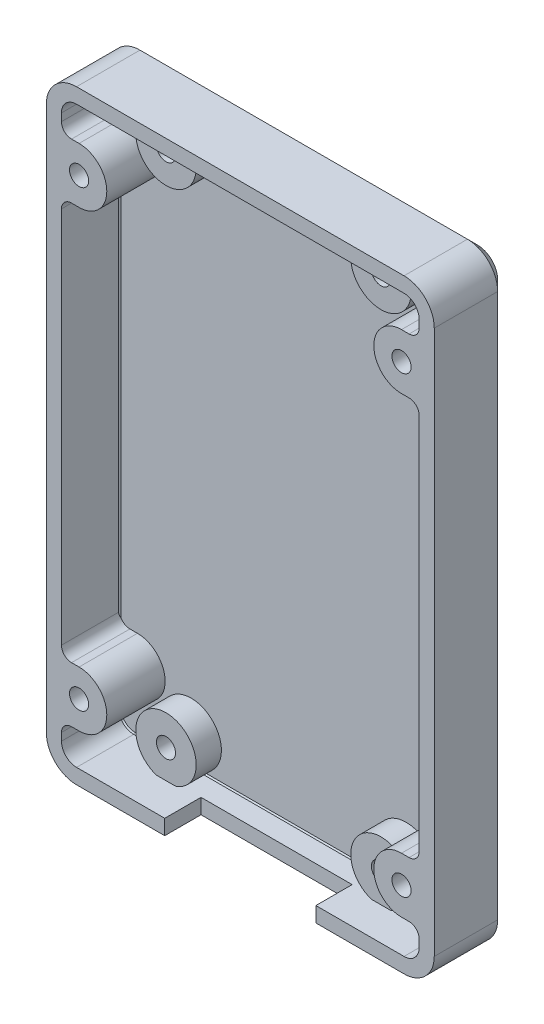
ISO-10303-21;
HEADER;
FILE_DESCRIPTION(('STEP AP214'),'2;1');
FILE_NAME('part.step','',(''),(''),'','','');
FILE_SCHEMA(('AUTOMOTIVE_DESIGN { 1 0 10303 214 1 1 1 1 }'));
ENDSEC;
DATA;
#1=APPLICATION_CONTEXT('core data for automotive mechanical design processes');
#2=APPLICATION_PROTOCOL_DEFINITION('international standard','automotive_design',2000,#1);
#3=PRODUCT_CONTEXT('',#1,'mechanical');
#4=PRODUCT('Part','Part','',(#3));
#5=PRODUCT_RELATED_PRODUCT_CATEGORY('part','',(#4));
#6=PRODUCT_DEFINITION_FORMATION('','',#4);
#7=PRODUCT_DEFINITION_CONTEXT('part definition',#1,'design');
#8=PRODUCT_DEFINITION('design','',#6,#7);
#9=PRODUCT_DEFINITION_SHAPE('','',#8);
#10=(LENGTH_UNIT() NAMED_UNIT(*) SI_UNIT(.MILLI.,.METRE.));
#11=(NAMED_UNIT(*) PLANE_ANGLE_UNIT() SI_UNIT($,.RADIAN.));
#12=(NAMED_UNIT(*) SI_UNIT($,.STERADIAN.) SOLID_ANGLE_UNIT());
#13=UNCERTAINTY_MEASURE_WITH_UNIT(LENGTH_MEASURE(1.E-05),#10,'distance_accuracy_value','');
#14=(GEOMETRIC_REPRESENTATION_CONTEXT(3) GLOBAL_UNCERTAINTY_ASSIGNED_CONTEXT((#13)) GLOBAL_UNIT_ASSIGNED_CONTEXT((#10,
#11,#12)) REPRESENTATION_CONTEXT('',''));
#15=CARTESIAN_POINT('',(0.,0.,0.));
#16=DIRECTION('',(0.,0.,1.));
#17=DIRECTION('',(1.,0.,0.));
#18=AXIS2_PLACEMENT_3D('',#15,#16,#17);
#19=CARTESIAN_POINT('',(19.0350377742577,30.0387070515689,3.29232344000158));
#20=DIRECTION('',(0.,0.,1.));
#21=DIRECTION('',(1.,0.,0.));
#22=AXIS2_PLACEMENT_3D('',#19,#20,#21);
#23=PLANE('',#22);
#24=CARTESIAN_POINT('',(15.7850377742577,22.5287070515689,3.29232344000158));
#25=DIRECTION('',(0.,0.,1.));
#26=DIRECTION('',(1.,0.,0.));
#27=AXIS2_PLACEMENT_3D('',#24,#25,#26);
#28=CIRCLE('',#27,0.950000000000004);
#29=CARTESIAN_POINT('',(16.7350377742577,22.5287070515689,3.29232344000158));
#30=VERTEX_POINT('',#29);
#31=EDGE_CURVE('E494',#30,#30,#28,.F.);
#32=ORIENTED_EDGE('',*,*,#31,.T.);
#33=EDGE_LOOP('',(#32));
#34=FACE_BOUND('',#33,.T.);
#35=CARTESIAN_POINT('',(15.7850377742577,-22.4712929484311,3.29232344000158));
#36=DIRECTION('',(0.,0.,1.));
#37=DIRECTION('',(1.,0.,0.));
#38=AXIS2_PLACEMENT_3D('',#35,#36,#37);
#39=CIRCLE('',#38,0.950000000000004);
#40=CARTESIAN_POINT('',(16.7350377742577,-22.4712929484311,3.29232344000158));
#41=VERTEX_POINT('',#40);
#42=EDGE_CURVE('E506',#41,#41,#39,.F.);
#43=ORIENTED_EDGE('',*,*,#42,.T.);
#44=EDGE_LOOP('',(#43));
#45=FACE_BOUND('',#44,.T.);
#46=CARTESIAN_POINT('',(-16.2149622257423,22.5287070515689,3.29232344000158));
#47=DIRECTION('',(0.,0.,1.));
#48=DIRECTION('',(1.,0.,0.));
#49=AXIS2_PLACEMENT_3D('',#46,#47,#48);
#50=CIRCLE('',#49,0.949999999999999);
#51=CARTESIAN_POINT('',(-15.2649622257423,22.5287070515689,3.29232344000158));
#52=VERTEX_POINT('',#51);
#53=EDGE_CURVE('E508',#52,#52,#50,.F.);
#54=ORIENTED_EDGE('',*,*,#53,.T.);
#55=EDGE_LOOP('',(#54));
#56=FACE_BOUND('',#55,.T.);
#57=CARTESIAN_POINT('',(-16.2149622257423,-22.4712929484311,3.29232344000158));
#58=DIRECTION('',(0.,0.,1.));
#59=DIRECTION('',(1.,0.,0.));
#60=AXIS2_PLACEMENT_3D('',#57,#58,#59);
#61=CIRCLE('',#60,0.949999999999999);
#62=CARTESIAN_POINT('',(-15.2649622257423,-22.4712929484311,3.29232344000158));
#63=VERTEX_POINT('',#62);
#64=EDGE_CURVE('E499',#63,#63,#61,.F.);
#65=ORIENTED_EDGE('',*,*,#64,.T.);
#66=EDGE_LOOP('',(#65));
#67=FACE_BOUND('',#66,.T.);
#68=CARTESIAN_POINT('',(-16.4649622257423,27.0287070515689,3.29232344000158));
#69=DIRECTION('',(0.,0.,1.));
#70=DIRECTION('',(1.,0.,0.));
#71=AXIS2_PLACEMENT_3D('',#68,#69,#70);
#72=CIRCLE('',#71,3.);
#73=CARTESIAN_POINT('',(-19.4649622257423,27.0287070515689,3.29232344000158));
#74=VERTEX_POINT('',#73);
#75=CARTESIAN_POINT('',(-16.4649622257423,30.0287070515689,3.29232344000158));
#76=VERTEX_POINT('',#75);
#77=EDGE_CURVE('E978',#74,#76,#72,.F.);
#78=ORIENTED_EDGE('',*,*,#77,.F.);
#79=DIRECTION('',(0.,1.,0.));
#80=VECTOR('',#79,1.);
#81=CARTESIAN_POINT('',(-19.4649622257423,30.0287070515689,3.29232344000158));
#82=LINE('',#81,#80);
#83=CARTESIAN_POINT('',(-19.4649622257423,-26.9712929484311,3.29232344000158));
#84=VERTEX_POINT('',#83);
#85=EDGE_CURVE('E983',#84,#74,#82,.T.);
#86=ORIENTED_EDGE('',*,*,#85,.F.);
#87=CARTESIAN_POINT('',(-16.4649622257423,-26.9712929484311,3.29232344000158));
#88=DIRECTION('',(0.,0.,1.));
#89=DIRECTION('',(1.,0.,0.));
#90=AXIS2_PLACEMENT_3D('',#87,#88,#89);
#91=CIRCLE('',#90,3.);
#92=CARTESIAN_POINT('',(-16.4649622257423,-29.9712929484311,3.29232344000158));
#93=VERTEX_POINT('',#92);
#94=EDGE_CURVE('E968',#93,#84,#91,.F.);
#95=ORIENTED_EDGE('',*,*,#94,.F.);
#96=DIRECTION('',(-1.,0.,0.));
#97=VECTOR('',#96,1.);
#98=CARTESIAN_POINT('',(-19.4649622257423,-29.9712929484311,3.29232344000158));
#99=LINE('',#98,#97);
#100=CARTESIAN_POINT('',(-7.71495979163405,-29.9712929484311,3.29232344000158));
#101=VERTEX_POINT('',#100);
#102=EDGE_CURVE('E982',#101,#93,#99,.T.);
#103=ORIENTED_EDGE('',*,*,#102,.F.);
#104=DIRECTION('',(0.,1.,0.));
#105=VECTOR('',#104,1.);
#106=CARTESIAN_POINT('',(-7.71495979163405,-11.8327833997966,3.29232344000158));
#107=LINE('',#106,#105);
#108=CARTESIAN_POINT('',(-7.71495979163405,-28.4712929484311,3.29232344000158));
#109=VERTEX_POINT('',#108);
#110=EDGE_CURVE('E491',#101,#109,#107,.T.);
#111=ORIENTED_EDGE('',*,*,#110,.T.);
#112=DIRECTION('',(-1.,0.,0.));
#113=VECTOR('',#112,1.);
#114=CARTESIAN_POINT('',(-19.4649622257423,-28.4712929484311,3.29232344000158));
#115=LINE('',#114,#113);
#116=CARTESIAN_POINT('',(-16.4649622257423,-28.4712929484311,3.29232344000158));
#117=VERTEX_POINT('',#116);
#118=EDGE_CURVE('E486',#109,#117,#115,.T.);
#119=ORIENTED_EDGE('',*,*,#118,.T.);
#120=CARTESIAN_POINT('',(-16.4649622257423,-26.9712929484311,3.29232344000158));
#121=DIRECTION('',(0.,0.,1.));
#122=DIRECTION('',(1.,0.,0.));
#123=AXIS2_PLACEMENT_3D('',#120,#121,#122);
#124=CIRCLE('',#123,1.5);
#125=CARTESIAN_POINT('',(-17.9649622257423,-26.9712929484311,3.29232344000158));
#126=VERTEX_POINT('',#125);
#127=EDGE_CURVE('E500',#117,#126,#124,.F.);
#128=ORIENTED_EDGE('',*,*,#127,.T.);
#129=DIRECTION('',(0.,1.,0.));
#130=VECTOR('',#129,1.);
#131=CARTESIAN_POINT('',(-17.9649622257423,30.0287070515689,3.29232344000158));
#132=LINE('',#131,#130);
#133=CARTESIAN_POINT('',(-17.9649622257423,-26.2212929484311,3.29232344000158));
#134=VERTEX_POINT('',#133);
#135=EDGE_CURVE('E999',#126,#134,#132,.T.);
#136=ORIENTED_EDGE('',*,*,#135,.T.);
#137=CARTESIAN_POINT('',(-16.9649622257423,-26.2212929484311,3.29232344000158));
#138=DIRECTION('',(0.,0.,1.));
#139=DIRECTION('',(1.,0.,0.));
#140=AXIS2_PLACEMENT_3D('',#137,#138,#139);
#141=CIRCLE('',#140,1.);
#142=CARTESIAN_POINT('',(-16.9649622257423,-25.2212929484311,3.29232344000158));
#143=VERTEX_POINT('',#142);
#144=EDGE_CURVE('E680',#134,#143,#141,.F.);
#145=ORIENTED_EDGE('',*,*,#144,.T.);
#146=DIRECTION('',(-1.,0.,0.));
#147=VECTOR('',#146,1.);
#148=CARTESIAN_POINT('',(-16.2149622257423,-25.2212929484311,3.29232344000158));
#149=LINE('',#148,#147);
#150=CARTESIAN_POINT('',(-16.2149622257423,-25.2212929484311,3.29232344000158));
#151=VERTEX_POINT('',#150);
#152=EDGE_CURVE('E946',#151,#143,#149,.T.);
#153=ORIENTED_EDGE('',*,*,#152,.F.);
#154=CARTESIAN_POINT('',(-16.2149622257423,-22.4712929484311,3.29232344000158));
#155=DIRECTION('',(0.,0.,1.));
#156=DIRECTION('',(1.,0.,0.));
#157=AXIS2_PLACEMENT_3D('',#154,#155,#156);
#158=CIRCLE('',#157,2.75);
#159=CARTESIAN_POINT('',(-16.2149622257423,-19.7212929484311,3.29232344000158));
#160=VERTEX_POINT('',#159);
#161=EDGE_CURVE('E951',#160,#151,#158,.F.);
#162=ORIENTED_EDGE('',*,*,#161,.F.);
#163=DIRECTION('',(1.,0.,0.));
#164=VECTOR('',#163,1.);
#165=CARTESIAN_POINT('',(-16.2149622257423,-19.7212929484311,3.29232344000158));
#166=LINE('',#165,#164);
#167=CARTESIAN_POINT('',(-16.9649622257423,-19.7212929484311,3.29232344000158));
#168=VERTEX_POINT('',#167);
#169=EDGE_CURVE('E952',#168,#160,#166,.T.);
#170=ORIENTED_EDGE('',*,*,#169,.F.);
#171=CARTESIAN_POINT('',(-16.9649622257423,-18.7212929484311,3.29232344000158));
#172=DIRECTION('',(0.,0.,1.));
#173=DIRECTION('',(1.,0.,0.));
#174=AXIS2_PLACEMENT_3D('',#171,#172,#173);
#175=CIRCLE('',#174,1.);
#176=CARTESIAN_POINT('',(-17.9649622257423,-18.7212929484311,3.29232344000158));
#177=VERTEX_POINT('',#176);
#178=EDGE_CURVE('E677',#168,#177,#175,.F.);
#179=ORIENTED_EDGE('',*,*,#178,.T.);
#180=DIRECTION('',(0.,1.,0.));
#181=VECTOR('',#180,1.);
#182=CARTESIAN_POINT('',(-17.9649622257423,30.0287070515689,3.29232344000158));
#183=LINE('',#182,#181);
#184=CARTESIAN_POINT('',(-17.9649622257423,18.7787070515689,3.29232344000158));
#185=VERTEX_POINT('',#184);
#186=EDGE_CURVE('E689',#177,#185,#183,.T.);
#187=ORIENTED_EDGE('',*,*,#186,.T.);
#188=CARTESIAN_POINT('',(-16.9649622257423,18.7787070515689,3.29232344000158));
#189=DIRECTION('',(0.,0.,1.));
#190=DIRECTION('',(1.,0.,0.));
#191=AXIS2_PLACEMENT_3D('',#188,#189,#190);
#192=CIRCLE('',#191,1.);
#193=CARTESIAN_POINT('',(-16.9649622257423,19.7787070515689,3.29232344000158));
#194=VERTEX_POINT('',#193);
#195=EDGE_CURVE('E673',#185,#194,#192,.F.);
#196=ORIENTED_EDGE('',*,*,#195,.T.);
#197=DIRECTION('',(-1.,0.,0.));
#198=VECTOR('',#197,1.);
#199=CARTESIAN_POINT('',(-16.2149622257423,19.7787070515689,3.29232344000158));
#200=LINE('',#199,#198);
#201=CARTESIAN_POINT('',(-16.2149622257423,19.7787070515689,3.29232344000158));
#202=VERTEX_POINT('',#201);
#203=EDGE_CURVE('E942',#202,#194,#200,.T.);
#204=ORIENTED_EDGE('',*,*,#203,.F.);
#205=CARTESIAN_POINT('',(-16.2149622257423,22.5287070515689,3.29232344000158));
#206=DIRECTION('',(0.,0.,1.));
#207=DIRECTION('',(1.,0.,0.));
#208=AXIS2_PLACEMENT_3D('',#205,#206,#207);
#209=CIRCLE('',#208,2.75);
#210=CARTESIAN_POINT('',(-16.2149622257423,25.2787070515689,3.29232344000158));
#211=VERTEX_POINT('',#210);
#212=EDGE_CURVE('E944',#211,#202,#209,.F.);
#213=ORIENTED_EDGE('',*,*,#212,.F.);
#214=DIRECTION('',(1.,0.,0.));
#215=VECTOR('',#214,1.);
#216=CARTESIAN_POINT('',(-16.2149622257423,25.2787070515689,3.29232344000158));
#217=LINE('',#216,#215);
#218=CARTESIAN_POINT('',(-16.9649622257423,25.2787070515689,3.29232344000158));
#219=VERTEX_POINT('',#218);
#220=EDGE_CURVE('E937',#219,#211,#217,.T.);
#221=ORIENTED_EDGE('',*,*,#220,.F.);
#222=CARTESIAN_POINT('',(-16.9649622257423,26.2787070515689,3.29232344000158));
#223=DIRECTION('',(0.,0.,1.));
#224=DIRECTION('',(1.,0.,0.));
#225=AXIS2_PLACEMENT_3D('',#222,#223,#224);
#226=CIRCLE('',#225,1.);
#227=CARTESIAN_POINT('',(-17.9649622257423,26.2787070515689,3.29232344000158));
#228=VERTEX_POINT('',#227);
#229=EDGE_CURVE('E668',#219,#228,#226,.F.);
#230=ORIENTED_EDGE('',*,*,#229,.T.);
#231=DIRECTION('',(0.,1.,0.));
#232=VECTOR('',#231,1.);
#233=CARTESIAN_POINT('',(-17.9649622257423,30.0287070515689,3.29232344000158));
#234=LINE('',#233,#232);
#235=CARTESIAN_POINT('',(-17.9649622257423,27.0287070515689,3.29232344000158));
#236=VERTEX_POINT('',#235);
#237=EDGE_CURVE('E993',#228,#236,#234,.T.);
#238=ORIENTED_EDGE('',*,*,#237,.T.);
#239=CARTESIAN_POINT('',(-16.4649622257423,27.0287070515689,3.29232344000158));
#240=DIRECTION('',(0.,0.,1.));
#241=DIRECTION('',(1.,0.,0.));
#242=AXIS2_PLACEMENT_3D('',#239,#240,#241);
#243=CIRCLE('',#242,1.5);
#244=CARTESIAN_POINT('',(-16.4649622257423,28.5287070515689,3.29232344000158));
#245=VERTEX_POINT('',#244);
#246=EDGE_CURVE('E1004',#236,#245,#243,.F.);
#247=ORIENTED_EDGE('',*,*,#246,.T.);
#248=DIRECTION('',(1.,0.,0.));
#249=VECTOR('',#248,1.);
#250=CARTESIAN_POINT('',(-19.4649622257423,28.5287070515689,3.29232344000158));
#251=LINE('',#250,#249);
#252=CARTESIAN_POINT('',(16.0350377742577,28.5287070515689,3.29232344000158));
#253=VERTEX_POINT('',#252);
#254=EDGE_CURVE('E1005',#245,#253,#251,.T.);
#255=ORIENTED_EDGE('',*,*,#254,.T.);
#256=CARTESIAN_POINT('',(16.0350377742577,27.0287070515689,3.29232344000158));
#257=DIRECTION('',(0.,0.,1.));
#258=DIRECTION('',(1.,0.,0.));
#259=AXIS2_PLACEMENT_3D('',#256,#257,#258);
#260=CIRCLE('',#259,1.5);
#261=CARTESIAN_POINT('',(17.5350377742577,27.0287070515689,3.29232344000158));
#262=VERTEX_POINT('',#261);
#263=EDGE_CURVE('E1006',#253,#262,#260,.F.);
#264=ORIENTED_EDGE('',*,*,#263,.T.);
#265=DIRECTION('',(0.,-1.,0.));
#266=VECTOR('',#265,1.);
#267=CARTESIAN_POINT('',(17.5350377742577,30.0287070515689,3.29232344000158));
#268=LINE('',#267,#266);
#269=CARTESIAN_POINT('',(17.5350377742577,26.2787070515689,3.29232344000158));
#270=VERTEX_POINT('',#269);
#271=EDGE_CURVE('E487',#262,#270,#268,.T.);
#272=ORIENTED_EDGE('',*,*,#271,.T.);
#273=CARTESIAN_POINT('',(16.5350377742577,26.2787070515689,3.29232344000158));
#274=DIRECTION('',(0.,0.,1.));
#275=DIRECTION('',(1.,0.,0.));
#276=AXIS2_PLACEMENT_3D('',#273,#274,#275);
#277=CIRCLE('',#276,1.);
#278=CARTESIAN_POINT('',(16.5350377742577,25.2787070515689,3.29232344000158));
#279=VERTEX_POINT('',#278);
#280=EDGE_CURVE('E671',#270,#279,#277,.F.);
#281=ORIENTED_EDGE('',*,*,#280,.T.);
#282=DIRECTION('',(1.,0.,0.));
#283=VECTOR('',#282,1.);
#284=CARTESIAN_POINT('',(15.7850377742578,25.2787070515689,3.29232344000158));
#285=LINE('',#284,#283);
#286=CARTESIAN_POINT('',(15.7850377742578,25.2787070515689,3.29232344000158));
#287=VERTEX_POINT('',#286);
#288=EDGE_CURVE('E965',#287,#279,#285,.T.);
#289=ORIENTED_EDGE('',*,*,#288,.F.);
#290=CARTESIAN_POINT('',(15.7850377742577,22.5287070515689,3.29232344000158));
#291=DIRECTION('',(0.,0.,1.));
#292=DIRECTION('',(1.,0.,0.));
#293=AXIS2_PLACEMENT_3D('',#290,#291,#292);
#294=CIRCLE('',#293,2.75);
#295=CARTESIAN_POINT('',(15.7850377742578,19.7787070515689,3.29232344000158));
#296=VERTEX_POINT('',#295);
#297=EDGE_CURVE('E964',#296,#287,#294,.F.);
#298=ORIENTED_EDGE('',*,*,#297,.F.);
#299=DIRECTION('',(-1.,0.,0.));
#300=VECTOR('',#299,1.);
#301=CARTESIAN_POINT('',(15.7850377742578,19.7787070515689,3.29232344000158));
#302=LINE('',#301,#300);
#303=CARTESIAN_POINT('',(16.5350377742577,19.7787070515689,3.29232344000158));
#304=VERTEX_POINT('',#303);
#305=EDGE_CURVE('E969',#304,#296,#302,.T.);
#306=ORIENTED_EDGE('',*,*,#305,.F.);
#307=CARTESIAN_POINT('',(16.5350377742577,18.7787070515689,3.29232344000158));
#308=DIRECTION('',(0.,0.,1.));
#309=DIRECTION('',(1.,0.,0.));
#310=AXIS2_PLACEMENT_3D('',#307,#308,#309);
#311=CIRCLE('',#310,1.);
#312=CARTESIAN_POINT('',(17.5350377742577,18.7787070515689,3.29232344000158));
#313=VERTEX_POINT('',#312);
#314=EDGE_CURVE('E672',#304,#313,#311,.F.);
#315=ORIENTED_EDGE('',*,*,#314,.T.);
#316=DIRECTION('',(0.,-1.,0.));
#317=VECTOR('',#316,1.);
#318=CARTESIAN_POINT('',(17.5350377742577,30.0287070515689,3.29232344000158));
#319=LINE('',#318,#317);
#320=CARTESIAN_POINT('',(17.5350377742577,-18.7212929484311,3.29232344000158));
#321=VERTEX_POINT('',#320);
#322=EDGE_CURVE('E686',#313,#321,#319,.T.);
#323=ORIENTED_EDGE('',*,*,#322,.T.);
#324=CARTESIAN_POINT('',(16.5350377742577,-18.7212929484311,3.29232344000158));
#325=DIRECTION('',(0.,0.,1.));
#326=DIRECTION('',(1.,0.,0.));
#327=AXIS2_PLACEMENT_3D('',#324,#325,#326);
#328=CIRCLE('',#327,1.);
#329=CARTESIAN_POINT('',(16.5350377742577,-19.7212929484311,3.29232344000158));
#330=VERTEX_POINT('',#329);
#331=EDGE_CURVE('E11',#321,#330,#328,.F.);
#332=ORIENTED_EDGE('',*,*,#331,.T.);
#333=DIRECTION('',(1.,0.,0.));
#334=VECTOR('',#333,1.);
#335=CARTESIAN_POINT('',(15.7850377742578,-19.7212929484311,3.29232344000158));
#336=LINE('',#335,#334);
#337=CARTESIAN_POINT('',(15.7850377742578,-19.7212929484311,3.29232344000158));
#338=VERTEX_POINT('',#337);
#339=EDGE_CURVE('E960',#338,#330,#336,.T.);
#340=ORIENTED_EDGE('',*,*,#339,.F.);
#341=CARTESIAN_POINT('',(15.7850377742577,-22.4712929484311,3.29232344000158));
#342=DIRECTION('',(0.,0.,1.));
#343=DIRECTION('',(1.,0.,0.));
#344=AXIS2_PLACEMENT_3D('',#341,#342,#343);
#345=CIRCLE('',#344,2.75);
#346=CARTESIAN_POINT('',(15.7850377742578,-25.2212929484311,3.29232344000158));
#347=VERTEX_POINT('',#346);
#348=EDGE_CURVE('E957',#347,#338,#345,.F.);
#349=ORIENTED_EDGE('',*,*,#348,.F.);
#350=DIRECTION('',(-1.,0.,0.));
#351=VECTOR('',#350,1.);
#352=CARTESIAN_POINT('',(15.7850377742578,-25.2212929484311,3.29232344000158));
#353=LINE('',#352,#351);
#354=CARTESIAN_POINT('',(16.5350377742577,-25.2212929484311,3.29232344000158));
#355=VERTEX_POINT('',#354);
#356=EDGE_CURVE('E685',#355,#347,#353,.T.);
#357=ORIENTED_EDGE('',*,*,#356,.F.);
#358=CARTESIAN_POINT('',(16.5350377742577,-26.2212929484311,3.29232344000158));
#359=DIRECTION('',(0.,0.,1.));
#360=DIRECTION('',(1.,0.,0.));
#361=AXIS2_PLACEMENT_3D('',#358,#359,#360);
#362=CIRCLE('',#361,1.);
#363=CARTESIAN_POINT('',(17.5350377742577,-26.2212929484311,3.29232344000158));
#364=VERTEX_POINT('',#363);
#365=EDGE_CURVE('E47',#355,#364,#362,.F.);
#366=ORIENTED_EDGE('',*,*,#365,.T.);
#367=DIRECTION('',(0.,-1.,0.));
#368=VECTOR('',#367,1.);
#369=CARTESIAN_POINT('',(17.5350377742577,30.0287070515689,3.29232344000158));
#370=LINE('',#369,#368);
#371=CARTESIAN_POINT('',(17.5350377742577,-26.9712929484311,3.29232344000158));
#372=VERTEX_POINT('',#371);
#373=EDGE_CURVE('E683',#364,#372,#370,.T.);
#374=ORIENTED_EDGE('',*,*,#373,.T.);
#375=CARTESIAN_POINT('',(16.0350377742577,-26.9712929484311,3.29232344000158));
#376=DIRECTION('',(0.,0.,1.));
#377=DIRECTION('',(1.,0.,0.));
#378=AXIS2_PLACEMENT_3D('',#375,#376,#377);
#379=CIRCLE('',#378,1.5);
#380=CARTESIAN_POINT('',(16.0350377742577,-28.4712929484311,3.29232344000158));
#381=VERTEX_POINT('',#380);
#382=EDGE_CURVE('E488',#372,#381,#379,.F.);
#383=ORIENTED_EDGE('',*,*,#382,.T.);
#384=CARTESIAN_POINT('',(7.28504020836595,-28.4712929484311,3.29232344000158));
#385=VERTEX_POINT('',#384);
#386=EDGE_CURVE('E471',#381,#385,#115,.T.);
#387=ORIENTED_EDGE('',*,*,#386,.T.);
#388=DIRECTION('',(0.,-1.,0.));
#389=VECTOR('',#388,1.);
#390=CARTESIAN_POINT('',(7.28504020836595,-11.8327833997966,3.29232344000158));
#391=LINE('',#390,#389);
#392=CARTESIAN_POINT('',(7.28504020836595,-29.9712929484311,3.29232344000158));
#393=VERTEX_POINT('',#392);
#394=EDGE_CURVE('E481',#385,#393,#391,.T.);
#395=ORIENTED_EDGE('',*,*,#394,.T.);
#396=CARTESIAN_POINT('',(16.0350377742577,-29.9712929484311,3.29232344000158));
#397=VERTEX_POINT('',#396);
#398=EDGE_CURVE('E990',#397,#393,#99,.T.);
#399=ORIENTED_EDGE('',*,*,#398,.F.);
#400=CARTESIAN_POINT('',(16.0350377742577,-26.9712929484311,3.29232344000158));
#401=DIRECTION('',(0.,0.,1.));
#402=DIRECTION('',(1.,0.,0.));
#403=AXIS2_PLACEMENT_3D('',#400,#401,#402);
#404=CIRCLE('',#403,3.);
#405=CARTESIAN_POINT('',(19.0350377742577,-26.9712929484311,3.29232344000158));
#406=VERTEX_POINT('',#405);
#407=EDGE_CURVE('E975',#406,#397,#404,.F.);
#408=ORIENTED_EDGE('',*,*,#407,.F.);
#409=DIRECTION('',(0.,-1.,0.));
#410=VECTOR('',#409,1.);
#411=CARTESIAN_POINT('',(19.0350377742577,30.0287070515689,3.29232344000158));
#412=LINE('',#411,#410);
#413=CARTESIAN_POINT('',(19.0350377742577,27.0287070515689,3.29232344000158));
#414=VERTEX_POINT('',#413);
#415=EDGE_CURVE('E986',#414,#406,#412,.T.);
#416=ORIENTED_EDGE('',*,*,#415,.F.);
#417=CARTESIAN_POINT('',(16.0350377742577,27.0287070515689,3.29232344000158));
#418=DIRECTION('',(0.,0.,1.));
#419=DIRECTION('',(1.,0.,0.));
#420=AXIS2_PLACEMENT_3D('',#417,#418,#419);
#421=CIRCLE('',#420,3.);
#422=CARTESIAN_POINT('',(16.0350377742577,30.0287070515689,3.29232344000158));
#423=VERTEX_POINT('',#422);
#424=EDGE_CURVE('E973',#423,#414,#421,.F.);
#425=ORIENTED_EDGE('',*,*,#424,.F.);
#426=DIRECTION('',(1.,0.,0.));
#427=VECTOR('',#426,1.);
#428=CARTESIAN_POINT('',(-19.4649622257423,30.0287070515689,3.29232344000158));
#429=LINE('',#428,#427);
#430=EDGE_CURVE('E976',#76,#423,#429,.T.);
#431=ORIENTED_EDGE('',*,*,#430,.F.);
#432=EDGE_LOOP('',(#78,#86,#95,#103,#111,#119,#128,#136,#145,#153,#162,#170,#179,#187,#196,#204,
#213,#221,#230,#238,#247,#255,#264,#272,#281,#289,#298,#306,#315,#323,#332,#340,#349,#357,#366,
#374,#383,#387,#395,#399,#408,#416,#425,#431));
#433=FACE_BOUND('',#432,.T.);
#434=ADVANCED_FACE('F41',(#34,#45,#56,#67,#433),#23,.T.);
#435=CARTESIAN_POINT('',(-16.2149622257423,22.5287070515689,-3.));
#436=DIRECTION('',(0.,0.,1.));
#437=DIRECTION('',(1.,0.,0.));
#438=AXIS2_PLACEMENT_3D('',#435,#436,#437);
#439=PLANE('',#438);
#440=CARTESIAN_POINT('',(-16.2149622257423,22.5287070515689,-3.));
#441=DIRECTION('',(0.,0.,1.));
#442=DIRECTION('',(1.,0.,0.));
#443=AXIS2_PLACEMENT_3D('',#440,#441,#442);
#444=CIRCLE('',#443,0.949999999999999);
#445=CARTESIAN_POINT('',(-15.2649622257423,22.5287070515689,-3.));
#446=VERTEX_POINT('',#445);
#447=EDGE_CURVE('E597',#446,#446,#444,.T.);
#448=ORIENTED_EDGE('',*,*,#447,.T.);
#449=EDGE_LOOP('',(#448));
#450=FACE_BOUND('',#449,.T.);
#451=ADVANCED_FACE('F1152',(#450),#439,.T.);
#452=CARTESIAN_POINT('',(-16.2149622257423,22.5287070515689,-3.));
#453=DIRECTION('',(0.,0.,1.));
#454=DIRECTION('',(1.,0.,0.));
#455=AXIS2_PLACEMENT_3D('',#452,#453,#454);
#456=CYLINDRICAL_SURFACE('',#455,0.949999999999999);
#457=ORIENTED_EDGE('',*,*,#447,.F.);
#458=EDGE_LOOP('',(#457));
#459=FACE_BOUND('',#458,.T.);
#460=ORIENTED_EDGE('',*,*,#53,.F.);
#461=EDGE_LOOP('',(#460));
#462=FACE_BOUND('',#461,.T.);
#463=ADVANCED_FACE('F1156',(#459,#462),#456,.F.);
#464=CARTESIAN_POINT('',(15.7850377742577,-22.4712929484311,-3.));
#465=DIRECTION('',(0.,0.,1.));
#466=DIRECTION('',(1.,0.,0.));
#467=AXIS2_PLACEMENT_3D('',#464,#465,#466);
#468=PLANE('',#467);
#469=CARTESIAN_POINT('',(15.7850377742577,-22.4712929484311,-3.));
#470=DIRECTION('',(0.,0.,1.));
#471=DIRECTION('',(1.,0.,0.));
#472=AXIS2_PLACEMENT_3D('',#469,#470,#471);
#473=CIRCLE('',#472,0.950000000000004);
#474=CARTESIAN_POINT('',(16.7350377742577,-22.4712929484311,-3.));
#475=VERTEX_POINT('',#474);
#476=EDGE_CURVE('E601',#475,#475,#473,.T.);
#477=ORIENTED_EDGE('',*,*,#476,.T.);
#478=EDGE_LOOP('',(#477));
#479=FACE_BOUND('',#478,.T.);
#480=ADVANCED_FACE('F1165',(#479),#468,.T.);
#481=CARTESIAN_POINT('',(15.7850377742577,-22.4712929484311,-3.));
#482=DIRECTION('',(0.,0.,1.));
#483=DIRECTION('',(1.,0.,0.));
#484=AXIS2_PLACEMENT_3D('',#481,#482,#483);
#485=CYLINDRICAL_SURFACE('',#484,0.950000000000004);
#486=ORIENTED_EDGE('',*,*,#476,.F.);
#487=EDGE_LOOP('',(#486));
#488=FACE_BOUND('',#487,.T.);
#489=ORIENTED_EDGE('',*,*,#42,.F.);
#490=EDGE_LOOP('',(#489));
#491=FACE_BOUND('',#490,.T.);
#492=ADVANCED_FACE('F1180',(#488,#491),#485,.F.);
#493=CARTESIAN_POINT('',(-16.2149622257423,-22.4712929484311,-3.));
#494=DIRECTION('',(0.,0.,1.));
#495=DIRECTION('',(1.,0.,0.));
#496=AXIS2_PLACEMENT_3D('',#493,#494,#495);
#497=PLANE('',#496);
#498=CARTESIAN_POINT('',(-16.2149622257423,-22.4712929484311,-3.));
#499=DIRECTION('',(0.,0.,1.));
#500=DIRECTION('',(1.,0.,0.));
#501=AXIS2_PLACEMENT_3D('',#498,#499,#500);
#502=CIRCLE('',#501,0.949999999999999);
#503=CARTESIAN_POINT('',(-15.2649622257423,-22.4712929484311,-3.));
#504=VERTEX_POINT('',#503);
#505=EDGE_CURVE('E935',#504,#504,#502,.T.);
#506=ORIENTED_EDGE('',*,*,#505,.T.);
#507=EDGE_LOOP('',(#506));
#508=FACE_BOUND('',#507,.T.);
#509=ADVANCED_FACE('F1171',(#508),#497,.T.);
#510=CARTESIAN_POINT('',(-16.2149622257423,-22.4712929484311,-3.));
#511=DIRECTION('',(0.,0.,1.));
#512=DIRECTION('',(1.,0.,0.));
#513=AXIS2_PLACEMENT_3D('',#510,#511,#512);
#514=CYLINDRICAL_SURFACE('',#513,0.949999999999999);
#515=ORIENTED_EDGE('',*,*,#505,.F.);
#516=EDGE_LOOP('',(#515));
#517=FACE_BOUND('',#516,.T.);
#518=ORIENTED_EDGE('',*,*,#64,.F.);
#519=EDGE_LOOP('',(#518));
#520=FACE_BOUND('',#519,.T.);
#521=ADVANCED_FACE('F1178',(#517,#520),#514,.F.);
#522=CARTESIAN_POINT('',(15.7850377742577,22.5287070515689,-3.));
#523=DIRECTION('',(0.,0.,1.));
#524=DIRECTION('',(1.,0.,0.));
#525=AXIS2_PLACEMENT_3D('',#522,#523,#524);
#526=PLANE('',#525);
#527=CARTESIAN_POINT('',(15.7850377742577,22.5287070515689,-3.));
#528=DIRECTION('',(0.,0.,1.));
#529=DIRECTION('',(1.,0.,0.));
#530=AXIS2_PLACEMENT_3D('',#527,#528,#529);
#531=CIRCLE('',#530,0.950000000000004);
#532=CARTESIAN_POINT('',(16.7350377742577,22.5287070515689,-3.));
#533=VERTEX_POINT('',#532);
#534=EDGE_CURVE('E933',#533,#533,#531,.T.);
#535=ORIENTED_EDGE('',*,*,#534,.T.);
#536=EDGE_LOOP('',(#535));
#537=FACE_BOUND('',#536,.T.);
#538=ADVANCED_FACE('F1177',(#537),#526,.T.);
#539=CARTESIAN_POINT('',(15.7850377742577,22.5287070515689,-3.));
#540=DIRECTION('',(0.,0.,1.));
#541=DIRECTION('',(1.,0.,0.));
#542=AXIS2_PLACEMENT_3D('',#539,#540,#541);
#543=CYLINDRICAL_SURFACE('',#542,0.950000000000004);
#544=ORIENTED_EDGE('',*,*,#534,.F.);
#545=EDGE_LOOP('',(#544));
#546=FACE_BOUND('',#545,.T.);
#547=ORIENTED_EDGE('',*,*,#31,.F.);
#548=EDGE_LOOP('',(#547));
#549=FACE_BOUND('',#548,.T.);
#550=ADVANCED_FACE('F1185',(#546,#549),#543,.F.);
#551=CARTESIAN_POINT('',(17.5350377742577,30.0287070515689,-4.));
#552=DIRECTION('',(1.,0.,0.));
#553=DIRECTION('',(0.,1.,0.));
#554=AXIS2_PLACEMENT_3D('',#551,#552,#553);
#555=PLANE('',#554);
#556=ORIENTED_EDGE('',*,*,#322,.F.);
#557=DIRECTION('',(0.,0.,1.));
#558=VECTOR('',#557,1.);
#559=CARTESIAN_POINT('',(17.5350377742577,18.7787070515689,-4.));
#560=LINE('',#559,#558);
#561=CARTESIAN_POINT('',(17.5350377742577,18.7787070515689,-2.37867965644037));
#562=VERTEX_POINT('',#561);
#563=EDGE_CURVE('E641',#313,#562,#560,.F.);
#564=ORIENTED_EDGE('',*,*,#563,.T.);
#565=DIRECTION('',(0.,1.,0.));
#566=VECTOR('',#565,1.);
#567=CARTESIAN_POINT('',(17.5350377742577,30.0287070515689,-2.37867965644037));
#568=LINE('',#567,#566);
#569=CARTESIAN_POINT('',(17.5350377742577,-18.7212929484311,-2.37867965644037));
#570=VERTEX_POINT('',#569);
#571=EDGE_CURVE('E1131',#570,#562,#568,.T.);
#572=ORIENTED_EDGE('',*,*,#571,.F.);
#573=DIRECTION('',(0.,0.,-1.));
#574=VECTOR('',#573,1.);
#575=CARTESIAN_POINT('',(17.5350377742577,-18.7212929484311,-4.));
#576=LINE('',#575,#574);
#577=EDGE_CURVE('E645',#570,#321,#576,.F.);
#578=ORIENTED_EDGE('',*,*,#577,.T.);
#579=EDGE_LOOP('',(#556,#564,#572,#578));
#580=FACE_BOUND('',#579,.T.);
#581=ADVANCED_FACE('F1125',(#580),#555,.F.);
#582=ORIENTED_EDGE('',*,*,#373,.F.);
#583=DIRECTION('',(0.,0.,1.));
#584=VECTOR('',#583,1.);
#585=CARTESIAN_POINT('',(17.5350377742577,-26.2212929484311,-4.));
#586=LINE('',#585,#584);
#587=CARTESIAN_POINT('',(17.5350377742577,-26.2212929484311,-2.37867965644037));
#588=VERTEX_POINT('',#587);
#589=EDGE_CURVE('E65',#364,#588,#586,.F.);
#590=ORIENTED_EDGE('',*,*,#589,.T.);
#591=CARTESIAN_POINT('',(17.5350377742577,-26.9712929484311,-2.37867965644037));
#592=VERTEX_POINT('',#591);
#593=EDGE_CURVE('E527',#592,#588,#568,.T.);
#594=ORIENTED_EDGE('',*,*,#593,.F.);
#595=DIRECTION('',(0.,0.,1.));
#596=VECTOR('',#595,1.);
#597=CARTESIAN_POINT('',(17.5350377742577,-26.9712929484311,-4.));
#598=LINE('',#597,#596);
#599=EDGE_CURVE('E529',#372,#592,#598,.F.);
#600=ORIENTED_EDGE('',*,*,#599,.F.);
#601=EDGE_LOOP('',(#582,#590,#594,#600));
#602=FACE_BOUND('',#601,.T.);
#603=ADVANCED_FACE('F690',(#602),#555,.F.);
#604=CARTESIAN_POINT('',(-17.9649622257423,30.0287070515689,-4.));
#605=DIRECTION('',(-1.,0.,0.));
#606=DIRECTION('',(0.,-1.,0.));
#607=AXIS2_PLACEMENT_3D('',#604,#605,#606);
#608=PLANE('',#607);
#609=DIRECTION('',(0.,-1.,0.));
#610=VECTOR('',#609,1.);
#611=CARTESIAN_POINT('',(-17.9649622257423,30.0287070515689,-2.37867965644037));
#612=LINE('',#611,#610);
#613=CARTESIAN_POINT('',(-17.9649622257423,18.7787070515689,-2.37867965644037));
#614=VERTEX_POINT('',#613);
#615=CARTESIAN_POINT('',(-17.9649622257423,-18.7212929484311,-2.37867965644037));
#616=VERTEX_POINT('',#615);
#617=EDGE_CURVE('E1053',#614,#616,#612,.T.);
#618=ORIENTED_EDGE('',*,*,#617,.F.);
#619=DIRECTION('',(0.,0.,-1.));
#620=VECTOR('',#619,1.);
#621=CARTESIAN_POINT('',(-17.9649622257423,18.7787070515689,-4.));
#622=LINE('',#621,#620);
#623=EDGE_CURVE('E629',#614,#185,#622,.F.);
#624=ORIENTED_EDGE('',*,*,#623,.T.);
#625=ORIENTED_EDGE('',*,*,#186,.F.);
#626=DIRECTION('',(0.,0.,1.));
#627=VECTOR('',#626,1.);
#628=CARTESIAN_POINT('',(-17.9649622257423,-18.7212929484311,-4.));
#629=LINE('',#628,#627);
#630=EDGE_CURVE('E628',#177,#616,#629,.F.);
#631=ORIENTED_EDGE('',*,*,#630,.T.);
#632=EDGE_LOOP('',(#618,#624,#625,#631));
#633=FACE_BOUND('',#632,.T.);
#634=ADVANCED_FACE('F1055',(#633),#608,.F.);
#635=ORIENTED_EDGE('',*,*,#237,.F.);
#636=DIRECTION('',(0.,0.,1.));
#637=VECTOR('',#636,1.);
#638=CARTESIAN_POINT('',(-17.9649622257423,26.2787070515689,-4.));
#639=LINE('',#638,#637);
#640=CARTESIAN_POINT('',(-17.9649622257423,26.2787070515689,-2.37867965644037));
#641=VERTEX_POINT('',#640);
#642=EDGE_CURVE('E598',#228,#641,#639,.F.);
#643=ORIENTED_EDGE('',*,*,#642,.T.);
#644=CARTESIAN_POINT('',(-17.9649622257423,27.0287070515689,-2.37867965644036));
#645=VERTEX_POINT('',#644);
#646=EDGE_CURVE('E520',#645,#641,#612,.T.);
#647=ORIENTED_EDGE('',*,*,#646,.F.);
#648=DIRECTION('',(0.,0.,1.));
#649=VECTOR('',#648,1.);
#650=CARTESIAN_POINT('',(-17.9649622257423,27.0287070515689,-4.));
#651=LINE('',#650,#649);
#652=EDGE_CURVE('E517',#236,#645,#651,.F.);
#653=ORIENTED_EDGE('',*,*,#652,.F.);
#654=EDGE_LOOP('',(#635,#643,#647,#653));
#655=FACE_BOUND('',#654,.T.);
#656=ADVANCED_FACE('F1081',(#655),#608,.F.);
#657=CARTESIAN_POINT('',(17.5350377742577,26.2787070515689,-2.37867965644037));
#658=VERTEX_POINT('',#657);
#659=CARTESIAN_POINT('',(17.5350377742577,27.0287070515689,-2.37867965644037));
#660=VERTEX_POINT('',#659);
#661=EDGE_CURVE('E531',#658,#660,#568,.T.);
#662=ORIENTED_EDGE('',*,*,#661,.F.);
#663=DIRECTION('',(0.,0.,-1.));
#664=VECTOR('',#663,1.);
#665=CARTESIAN_POINT('',(17.5350377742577,26.2787070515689,-4.));
#666=LINE('',#665,#664);
#667=EDGE_CURVE('E640',#658,#270,#666,.F.);
#668=ORIENTED_EDGE('',*,*,#667,.T.);
#669=ORIENTED_EDGE('',*,*,#271,.F.);
#670=DIRECTION('',(0.,0.,1.));
#671=VECTOR('',#670,1.);
#672=CARTESIAN_POINT('',(17.5350377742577,27.0287070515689,-4.));
#673=LINE('',#672,#671);
#674=EDGE_CURVE('E535',#660,#262,#673,.T.);
#675=ORIENTED_EDGE('',*,*,#674,.F.);
#676=EDGE_LOOP('',(#662,#668,#669,#675));
#677=FACE_BOUND('',#676,.T.);
#678=ADVANCED_FACE('F1096',(#677),#555,.F.);
#679=CARTESIAN_POINT('',(-19.4649622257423,-28.4712929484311,-4.));
#680=DIRECTION('',(0.,-1.,0.));
#681=DIRECTION('',(0.,0.,-1.));
#682=AXIS2_PLACEMENT_3D('',#679,#680,#681);
#683=PLANE('',#682);
#684=ORIENTED_EDGE('',*,*,#386,.F.);
#685=DIRECTION('',(0.,0.,-1.));
#686=VECTOR('',#685,1.);
#687=CARTESIAN_POINT('',(16.0350377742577,-28.4712929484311,-4.));
#688=LINE('',#687,#686);
#689=CARTESIAN_POINT('',(16.0350377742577,-28.4712929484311,-2.37867965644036));
#690=VERTEX_POINT('',#689);
#691=EDGE_CURVE('E528',#690,#381,#688,.F.);
#692=ORIENTED_EDGE('',*,*,#691,.F.);
#693=DIRECTION('',(1.,0.,0.));
#694=VECTOR('',#693,1.);
#695=CARTESIAN_POINT('',(-19.4649622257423,-28.4712929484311,-2.37867965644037));
#696=LINE('',#695,#694);
#697=CARTESIAN_POINT('',(11.4018707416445,-28.4712929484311,-2.37867965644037));
#698=VERTEX_POINT('',#697);
#699=EDGE_CURVE('E530',#698,#690,#696,.T.);
#700=ORIENTED_EDGE('',*,*,#699,.F.);
#701=DIRECTION('',(0.,0.,-1.));
#702=VECTOR('',#701,1.);
#703=CARTESIAN_POINT('',(11.4018707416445,-28.4712929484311,0.));
#704=LINE('',#703,#702);
#705=CARTESIAN_POINT('',(11.4018707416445,-28.4712929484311,0.));
#706=VERTEX_POINT('',#705);
#707=EDGE_CURVE('E562',#698,#706,#704,.F.);
#708=ORIENTED_EDGE('',*,*,#707,.T.);
#709=DIRECTION('',(1.,0.,0.));
#710=VECTOR('',#709,1.);
#711=CARTESIAN_POINT('',(-19.4649622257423,-28.4712929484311,0.));
#712=LINE('',#711,#710);
#713=CARTESIAN_POINT('',(9.50420480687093,-28.4712929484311,0.));
#714=VERTEX_POINT('',#713);
#715=EDGE_CURVE('E943',#714,#706,#712,.T.);
#716=ORIENTED_EDGE('',*,*,#715,.F.);
#717=DIRECTION('',(0.,0.,-1.));
#718=VECTOR('',#717,1.);
#719=CARTESIAN_POINT('',(9.50420480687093,-28.4712929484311,0.));
#720=LINE('',#719,#718);
#721=CARTESIAN_POINT('',(9.50420480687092,-28.4712929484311,-2.37867965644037));
#722=VERTEX_POINT('',#721);
#723=EDGE_CURVE('E822',#714,#722,#720,.T.);
#724=ORIENTED_EDGE('',*,*,#723,.T.);
#725=CARTESIAN_POINT('',(-9.93412925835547,-28.4712929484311,-2.37867965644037));
#726=VERTEX_POINT('',#725);
#727=EDGE_CURVE('E2059',#726,#722,#696,.T.);
#728=ORIENTED_EDGE('',*,*,#727,.F.);
#729=DIRECTION('',(0.,0.,-1.));
#730=VECTOR('',#729,1.);
#731=CARTESIAN_POINT('',(-9.93412925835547,-28.4712929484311,0.));
#732=LINE('',#731,#730);
#733=CARTESIAN_POINT('',(-9.93412925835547,-28.4712929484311,0.));
#734=VERTEX_POINT('',#733);
#735=EDGE_CURVE('E834',#726,#734,#732,.F.);
#736=ORIENTED_EDGE('',*,*,#735,.T.);
#737=DIRECTION('',(1.,0.,0.));
#738=VECTOR('',#737,1.);
#739=CARTESIAN_POINT('',(-19.4649622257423,-28.4712929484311,0.));
#740=LINE('',#739,#738);
#741=CARTESIAN_POINT('',(-11.8317951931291,-28.4712929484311,0.));
#742=VERTEX_POINT('',#741);
#743=EDGE_CURVE('E2080',#742,#734,#740,.T.);
#744=ORIENTED_EDGE('',*,*,#743,.F.);
#745=DIRECTION('',(0.,0.,-1.));
#746=VECTOR('',#745,1.);
#747=CARTESIAN_POINT('',(-11.8317951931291,-28.4712929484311,0.));
#748=LINE('',#747,#746);
#749=CARTESIAN_POINT('',(-11.8317951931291,-28.4712929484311,-2.37867965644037));
#750=VERTEX_POINT('',#749);
#751=EDGE_CURVE('E836',#742,#750,#748,.T.);
#752=ORIENTED_EDGE('',*,*,#751,.T.);
#753=CARTESIAN_POINT('',(-16.4649622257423,-28.4712929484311,-2.37867965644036));
#754=VERTEX_POINT('',#753);
#755=EDGE_CURVE('E521',#754,#750,#696,.T.);
#756=ORIENTED_EDGE('',*,*,#755,.F.);
#757=DIRECTION('',(0.,0.,-1.));
#758=VECTOR('',#757,1.);
#759=CARTESIAN_POINT('',(-16.4649622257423,-28.4712929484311,-4.));
#760=LINE('',#759,#758);
#761=EDGE_CURVE('E524',#117,#754,#760,.T.);
#762=ORIENTED_EDGE('',*,*,#761,.F.);
#763=ORIENTED_EDGE('',*,*,#118,.F.);
#764=DIRECTION('',(0.,0.,1.));
#765=VECTOR('',#764,1.);
#766=CARTESIAN_POINT('',(-7.71495979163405,-28.4712929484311,-0.307676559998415));
#767=LINE('',#766,#765);
#768=CARTESIAN_POINT('',(-7.71495979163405,-28.4712929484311,-0.307676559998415));
#769=VERTEX_POINT('',#768);
#770=EDGE_CURVE('E479',#769,#109,#767,.T.);
#771=ORIENTED_EDGE('',*,*,#770,.F.);
#772=DIRECTION('',(-1.,0.,0.));
#773=VECTOR('',#772,1.);
#774=CARTESIAN_POINT('',(7.28504020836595,-28.4712929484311,-0.307676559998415));
#775=LINE('',#774,#773);
#776=CARTESIAN_POINT('',(7.28504020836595,-28.4712929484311,-0.307676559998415));
#777=VERTEX_POINT('',#776);
#778=EDGE_CURVE('E473',#777,#769,#775,.T.);
#779=ORIENTED_EDGE('',*,*,#778,.F.);
#780=DIRECTION('',(0.,0.,-1.));
#781=VECTOR('',#780,1.);
#782=CARTESIAN_POINT('',(7.28504020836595,-28.4712929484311,-0.307676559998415));
#783=LINE('',#782,#781);
#784=EDGE_CURVE('E470',#385,#777,#783,.T.);
#785=ORIENTED_EDGE('',*,*,#784,.F.);
#786=EDGE_LOOP('',(#684,#692,#700,#708,#716,#724,#728,#736,#744,#752,#756,#762,#763,#771,#779,#785));
#787=FACE_BOUND('',#786,.T.);
#788=ADVANCED_FACE('F469',(#787),#683,.F.);
#789=CARTESIAN_POINT('',(-17.9649622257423,-26.2212929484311,-2.37867965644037));
#790=VERTEX_POINT('',#789);
#791=CARTESIAN_POINT('',(-17.9649622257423,-26.9712929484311,-2.37867965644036));
#792=VERTEX_POINT('',#791);
#793=EDGE_CURVE('E523',#790,#792,#612,.T.);
#794=ORIENTED_EDGE('',*,*,#793,.F.);
#795=DIRECTION('',(0.,0.,-1.));
#796=VECTOR('',#795,1.);
#797=CARTESIAN_POINT('',(-17.9649622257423,-26.2212929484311,-4.));
#798=LINE('',#797,#796);
#799=EDGE_CURVE('E652',#790,#134,#798,.F.);
#800=ORIENTED_EDGE('',*,*,#799,.T.);
#801=ORIENTED_EDGE('',*,*,#135,.F.);
#802=DIRECTION('',(0.,0.,1.));
#803=VECTOR('',#802,1.);
#804=CARTESIAN_POINT('',(-17.9649622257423,-26.9712929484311,-4.));
#805=LINE('',#804,#803);
#806=EDGE_CURVE('E519',#792,#126,#805,.T.);
#807=ORIENTED_EDGE('',*,*,#806,.F.);
#808=EDGE_LOOP('',(#794,#800,#801,#807));
#809=FACE_BOUND('',#808,.T.);
#810=ADVANCED_FACE('F1023',(#809),#608,.F.);
#811=CARTESIAN_POINT('',(-19.4649622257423,28.5287070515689,-4.));
#812=DIRECTION('',(0.,1.,0.));
#813=DIRECTION('',(-1.,0.,0.));
#814=AXIS2_PLACEMENT_3D('',#811,#812,#813);
#815=PLANE('',#814);
#816=ORIENTED_EDGE('',*,*,#254,.F.);
#817=DIRECTION('',(0.,0.,1.));
#818=VECTOR('',#817,1.);
#819=CARTESIAN_POINT('',(-16.4649622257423,28.5287070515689,-4.));
#820=LINE('',#819,#818);
#821=CARTESIAN_POINT('',(-16.4649622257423,28.5287070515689,-2.37867965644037));
#822=VERTEX_POINT('',#821);
#823=EDGE_CURVE('E511',#822,#245,#820,.T.);
#824=ORIENTED_EDGE('',*,*,#823,.F.);
#825=DIRECTION('',(-1.,0.,0.));
#826=VECTOR('',#825,1.);
#827=CARTESIAN_POINT('',(-19.4649622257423,28.5287070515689,-2.37867965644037));
#828=LINE('',#827,#826);
#829=CARTESIAN_POINT('',(-11.8317951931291,28.5287070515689,-2.37867965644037));
#830=VERTEX_POINT('',#829);
#831=EDGE_CURVE('E513',#830,#822,#828,.T.);
#832=ORIENTED_EDGE('',*,*,#831,.F.);
#833=DIRECTION('',(0.,0.,-1.));
#834=VECTOR('',#833,1.);
#835=CARTESIAN_POINT('',(-11.8317951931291,28.5287070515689,0.));
#836=LINE('',#835,#834);
#837=CARTESIAN_POINT('',(-11.8317951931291,28.5287070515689,0.));
#838=VERTEX_POINT('',#837);
#839=EDGE_CURVE('E847',#830,#838,#836,.F.);
#840=ORIENTED_EDGE('',*,*,#839,.T.);
#841=DIRECTION('',(-1.,0.,0.));
#842=VECTOR('',#841,1.);
#843=CARTESIAN_POINT('',(-19.4649622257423,28.5287070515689,0.));
#844=LINE('',#843,#842);
#845=CARTESIAN_POINT('',(-9.93412925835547,28.5287070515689,0.));
#846=VERTEX_POINT('',#845);
#847=EDGE_CURVE('E2071',#846,#838,#844,.T.);
#848=ORIENTED_EDGE('',*,*,#847,.F.);
#849=DIRECTION('',(0.,0.,-1.));
#850=VECTOR('',#849,1.);
#851=CARTESIAN_POINT('',(-9.93412925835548,28.5287070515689,0.));
#852=LINE('',#851,#850);
#853=CARTESIAN_POINT('',(-9.93412925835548,28.5287070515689,-2.37867965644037));
#854=VERTEX_POINT('',#853);
#855=EDGE_CURVE('E852',#846,#854,#852,.T.);
#856=ORIENTED_EDGE('',*,*,#855,.T.);
#857=CARTESIAN_POINT('',(9.50420480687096,28.5287070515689,-2.37867965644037));
#858=VERTEX_POINT('',#857);
#859=EDGE_CURVE('E2065',#858,#854,#828,.T.);
#860=ORIENTED_EDGE('',*,*,#859,.F.);
#861=DIRECTION('',(0.,0.,-1.));
#862=VECTOR('',#861,1.);
#863=CARTESIAN_POINT('',(9.50420480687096,28.5287070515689,0.));
#864=LINE('',#863,#862);
#865=CARTESIAN_POINT('',(9.50420480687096,28.5287070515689,0.));
#866=VERTEX_POINT('',#865);
#867=EDGE_CURVE('E864',#858,#866,#864,.F.);
#868=ORIENTED_EDGE('',*,*,#867,.T.);
#869=DIRECTION('',(-1.,0.,0.));
#870=VECTOR('',#869,1.);
#871=CARTESIAN_POINT('',(-19.4649622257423,28.5287070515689,0.));
#872=LINE('',#871,#870);
#873=CARTESIAN_POINT('',(11.4018707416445,28.5287070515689,0.));
#874=VERTEX_POINT('',#873);
#875=EDGE_CURVE('E760',#874,#866,#872,.T.);
#876=ORIENTED_EDGE('',*,*,#875,.F.);
#877=DIRECTION('',(0.,0.,-1.));
#878=VECTOR('',#877,1.);
#879=CARTESIAN_POINT('',(11.4018707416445,28.5287070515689,0.));
#880=LINE('',#879,#878);
#881=CARTESIAN_POINT('',(11.4018707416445,28.5287070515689,-2.37867965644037));
#882=VERTEX_POINT('',#881);
#883=EDGE_CURVE('E869',#874,#882,#880,.T.);
#884=ORIENTED_EDGE('',*,*,#883,.T.);
#885=CARTESIAN_POINT('',(16.0350377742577,28.5287070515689,-2.37867965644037));
#886=VERTEX_POINT('',#885);
#887=EDGE_CURVE('E2061',#886,#882,#828,.T.);
#888=ORIENTED_EDGE('',*,*,#887,.F.);
#889=DIRECTION('',(0.,0.,1.));
#890=VECTOR('',#889,1.);
#891=CARTESIAN_POINT('',(16.0350377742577,28.5287070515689,-4.));
#892=LINE('',#891,#890);
#893=EDGE_CURVE('E515',#253,#886,#892,.F.);
#894=ORIENTED_EDGE('',*,*,#893,.F.);
#895=EDGE_LOOP('',(#816,#824,#832,#840,#848,#856,#860,#868,#876,#884,#888,#894));
#896=FACE_BOUND('',#895,.T.);
#897=ADVANCED_FACE('F1678',(#896),#815,.F.);
#898=CARTESIAN_POINT('',(-16.4649622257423,27.0287070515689,-4.));
#899=DIRECTION('',(0.,0.,1.));
#900=DIRECTION('',(1.,0.,0.));
#901=AXIS2_PLACEMENT_3D('',#898,#899,#900);
#902=CYLINDRICAL_SURFACE('',#901,1.5);
#903=ORIENTED_EDGE('',*,*,#246,.F.);
#904=ORIENTED_EDGE('',*,*,#652,.T.);
#905=CARTESIAN_POINT('',(-16.4649622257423,27.0287070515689,-2.37867965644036));
#906=DIRECTION('',(0.,0.,1.));
#907=DIRECTION('',(1.,0.,0.));
#908=AXIS2_PLACEMENT_3D('',#905,#906,#907);
#909=CIRCLE('',#908,1.5);
#910=EDGE_CURVE('E717',#822,#645,#909,.T.);
#911=ORIENTED_EDGE('',*,*,#910,.F.);
#912=ORIENTED_EDGE('',*,*,#823,.T.);
#913=EDGE_LOOP('',(#903,#904,#911,#912));
#914=FACE_BOUND('',#913,.T.);
#915=ADVANCED_FACE('F1090',(#914),#902,.F.);
#916=CARTESIAN_POINT('',(16.0350377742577,27.0287070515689,-4.));
#917=DIRECTION('',(0.,0.,1.));
#918=DIRECTION('',(1.,0.,0.));
#919=AXIS2_PLACEMENT_3D('',#916,#917,#918);
#920=CYLINDRICAL_SURFACE('',#919,1.5);
#921=ORIENTED_EDGE('',*,*,#263,.F.);
#922=ORIENTED_EDGE('',*,*,#893,.T.);
#923=CARTESIAN_POINT('',(16.0350377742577,27.0287070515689,-2.37867965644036));
#924=DIRECTION('',(0.,0.,1.));
#925=DIRECTION('',(1.,0.,0.));
#926=AXIS2_PLACEMENT_3D('',#923,#924,#925);
#927=CIRCLE('',#926,1.5);
#928=EDGE_CURVE('E724',#660,#886,#927,.T.);
#929=ORIENTED_EDGE('',*,*,#928,.F.);
#930=ORIENTED_EDGE('',*,*,#674,.T.);
#931=EDGE_LOOP('',(#921,#922,#929,#930));
#932=FACE_BOUND('',#931,.T.);
#933=ADVANCED_FACE('F1092',(#932),#920,.F.);
#934=CARTESIAN_POINT('',(16.0350377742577,-26.9712929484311,-4.));
#935=DIRECTION('',(0.,0.,1.));
#936=DIRECTION('',(1.,0.,0.));
#937=AXIS2_PLACEMENT_3D('',#934,#935,#936);
#938=CYLINDRICAL_SURFACE('',#937,1.5);
#939=ORIENTED_EDGE('',*,*,#382,.F.);
#940=ORIENTED_EDGE('',*,*,#599,.T.);
#941=CARTESIAN_POINT('',(16.0350377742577,-26.9712929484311,-2.37867965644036));
#942=DIRECTION('',(0.,0.,1.));
#943=DIRECTION('',(1.,0.,0.));
#944=AXIS2_PLACEMENT_3D('',#941,#942,#943);
#945=CIRCLE('',#944,1.5);
#946=EDGE_CURVE('E728',#690,#592,#945,.T.);
#947=ORIENTED_EDGE('',*,*,#946,.F.);
#948=ORIENTED_EDGE('',*,*,#691,.T.);
#949=EDGE_LOOP('',(#939,#940,#947,#948));
#950=FACE_BOUND('',#949,.T.);
#951=ADVANCED_FACE('F1694',(#950),#938,.F.);
#952=CARTESIAN_POINT('',(-16.4649622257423,-26.9712929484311,-4.));
#953=DIRECTION('',(0.,0.,1.));
#954=DIRECTION('',(1.,0.,0.));
#955=AXIS2_PLACEMENT_3D('',#952,#953,#954);
#956=CYLINDRICAL_SURFACE('',#955,1.5);
#957=ORIENTED_EDGE('',*,*,#127,.F.);
#958=ORIENTED_EDGE('',*,*,#761,.T.);
#959=CARTESIAN_POINT('',(-16.4649622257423,-26.9712929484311,-2.37867965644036));
#960=DIRECTION('',(0.,0.,1.));
#961=DIRECTION('',(1.,0.,0.));
#962=AXIS2_PLACEMENT_3D('',#959,#960,#961);
#963=CIRCLE('',#962,1.5);
#964=EDGE_CURVE('E732',#792,#754,#963,.T.);
#965=ORIENTED_EDGE('',*,*,#964,.F.);
#966=ORIENTED_EDGE('',*,*,#806,.T.);
#967=EDGE_LOOP('',(#957,#958,#965,#966));
#968=FACE_BOUND('',#967,.T.);
#969=ADVANCED_FACE('F1020',(#968),#956,.F.);
#970=CARTESIAN_POINT('',(-7.71495979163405,-11.8327833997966,-0.307676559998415));
#971=DIRECTION('',(-1.,0.,0.));
#972=DIRECTION('',(0.,0.,1.));
#973=AXIS2_PLACEMENT_3D('',#970,#971,#972);
#974=PLANE('',#973);
#975=ORIENTED_EDGE('',*,*,#110,.F.);
#976=DIRECTION('',(0.,0.,-1.));
#977=VECTOR('',#976,1.);
#978=CARTESIAN_POINT('',(-7.71495979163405,-29.9712929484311,-0.307676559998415));
#979=LINE('',#978,#977);
#980=CARTESIAN_POINT('',(-7.71495979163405,-29.9712929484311,-0.307676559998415));
#981=VERTEX_POINT('',#980);
#982=EDGE_CURVE('E565',#101,#981,#979,.T.);
#983=ORIENTED_EDGE('',*,*,#982,.T.);
#984=DIRECTION('',(0.,-1.,0.));
#985=VECTOR('',#984,1.);
#986=CARTESIAN_POINT('',(-7.71495979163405,-11.8327833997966,-0.307676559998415));
#987=LINE('',#986,#985);
#988=EDGE_CURVE('E561',#769,#981,#987,.T.);
#989=ORIENTED_EDGE('',*,*,#988,.F.);
#990=ORIENTED_EDGE('',*,*,#770,.T.);
#991=EDGE_LOOP('',(#975,#983,#989,#990));
#992=FACE_BOUND('',#991,.T.);
#993=ADVANCED_FACE('F1718',(#992),#974,.F.);
#994=CARTESIAN_POINT('',(7.28504020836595,-11.8327833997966,-0.307676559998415));
#995=DIRECTION('',(1.,0.,0.));
#996=DIRECTION('',(0.,0.,-1.));
#997=AXIS2_PLACEMENT_3D('',#994,#995,#996);
#998=PLANE('',#997);
#999=ORIENTED_EDGE('',*,*,#394,.F.);
#1000=ORIENTED_EDGE('',*,*,#784,.T.);
#1001=DIRECTION('',(0.,-1.,0.));
#1002=VECTOR('',#1001,1.);
#1003=CARTESIAN_POINT('',(7.28504020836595,-11.8327833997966,-0.307676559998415));
#1004=LINE('',#1003,#1002);
#1005=CARTESIAN_POINT('',(7.28504020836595,-29.9712929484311,-0.307676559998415));
#1006=VERTEX_POINT('',#1005);
#1007=EDGE_CURVE('E476',#777,#1006,#1004,.T.);
#1008=ORIENTED_EDGE('',*,*,#1007,.T.);
#1009=DIRECTION('',(0.,0.,1.));
#1010=VECTOR('',#1009,1.);
#1011=CARTESIAN_POINT('',(7.28504020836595,-29.9712929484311,-0.307676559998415));
#1012=LINE('',#1011,#1010);
#1013=EDGE_CURVE('E495',#1006,#393,#1012,.T.);
#1014=ORIENTED_EDGE('',*,*,#1013,.T.);
#1015=EDGE_LOOP('',(#999,#1000,#1008,#1014));
#1016=FACE_BOUND('',#1015,.T.);
#1017=ADVANCED_FACE('F489',(#1016),#998,.F.);
#1018=CARTESIAN_POINT('',(19.0350377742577,30.0287070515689,-4.));
#1019=DIRECTION('',(1.,0.,0.));
#1020=DIRECTION('',(0.,1.,0.));
#1021=AXIS2_PLACEMENT_3D('',#1018,#1019,#1020);
#1022=PLANE('',#1021);
#1023=DIRECTION('',(0.,0.,1.));
#1024=VECTOR('',#1023,1.);
#1025=CARTESIAN_POINT('',(19.0350377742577,27.0287070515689,-4.));
#1026=LINE('',#1025,#1024);
#1027=CARTESIAN_POINT('',(19.0350377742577,27.0287070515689,-3.00000000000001));
#1028=VERTEX_POINT('',#1027);
#1029=EDGE_CURVE('E545',#1028,#414,#1026,.T.);
#1030=ORIENTED_EDGE('',*,*,#1029,.T.);
#1031=ORIENTED_EDGE('',*,*,#415,.T.);
#1032=DIRECTION('',(0.,0.,1.));
#1033=VECTOR('',#1032,1.);
#1034=CARTESIAN_POINT('',(19.0350377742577,-26.9712929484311,-4.));
#1035=LINE('',#1034,#1033);
#1036=CARTESIAN_POINT('',(19.0350377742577,-26.9712929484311,-3.00000000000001));
#1037=VERTEX_POINT('',#1036);
#1038=EDGE_CURVE('E542',#406,#1037,#1035,.F.);
#1039=ORIENTED_EDGE('',*,*,#1038,.T.);
#1040=DIRECTION('',(0.,1.,0.));
#1041=VECTOR('',#1040,1.);
#1042=CARTESIAN_POINT('',(19.0350377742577,27.0287070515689,-3.00000000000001));
#1043=LINE('',#1042,#1041);
#1044=EDGE_CURVE('E787',#1037,#1028,#1043,.T.);
#1045=ORIENTED_EDGE('',*,*,#1044,.T.);
#1046=EDGE_LOOP('',(#1030,#1031,#1039,#1045));
#1047=FACE_BOUND('',#1046,.T.);
#1048=ADVANCED_FACE('F1757',(#1047),#1022,.T.);
#1049=CARTESIAN_POINT('',(-19.4649622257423,-29.9712929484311,-4.));
#1050=DIRECTION('',(0.,-1.,0.));
#1051=DIRECTION('',(0.,0.,-1.));
#1052=AXIS2_PLACEMENT_3D('',#1049,#1050,#1051);
#1053=PLANE('',#1052);
#1054=DIRECTION('',(0.,0.,1.));
#1055=VECTOR('',#1054,1.);
#1056=CARTESIAN_POINT('',(16.0350377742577,-29.9712929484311,-4.));
#1057=LINE('',#1056,#1055);
#1058=CARTESIAN_POINT('',(16.0350377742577,-29.9712929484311,-3.00000000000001));
#1059=VERTEX_POINT('',#1058);
#1060=EDGE_CURVE('E536',#1059,#397,#1057,.T.);
#1061=ORIENTED_EDGE('',*,*,#1060,.T.);
#1062=ORIENTED_EDGE('',*,*,#398,.T.);
#1063=ORIENTED_EDGE('',*,*,#1013,.F.);
#1064=DIRECTION('',(1.,0.,0.));
#1065=VECTOR('',#1064,1.);
#1066=CARTESIAN_POINT('',(7.28504020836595,-29.9712929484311,-0.307676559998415));
#1067=LINE('',#1066,#1065);
#1068=EDGE_CURVE('E557',#981,#1006,#1067,.T.);
#1069=ORIENTED_EDGE('',*,*,#1068,.F.);
#1070=ORIENTED_EDGE('',*,*,#982,.F.);
#1071=ORIENTED_EDGE('',*,*,#102,.T.);
#1072=DIRECTION('',(0.,0.,1.));
#1073=VECTOR('',#1072,1.);
#1074=CARTESIAN_POINT('',(-16.4649622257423,-29.9712929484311,-4.));
#1075=LINE('',#1074,#1073);
#1076=CARTESIAN_POINT('',(-16.4649622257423,-29.9712929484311,-3.00000000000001));
#1077=VERTEX_POINT('',#1076);
#1078=EDGE_CURVE('E538',#93,#1077,#1075,.F.);
#1079=ORIENTED_EDGE('',*,*,#1078,.T.);
#1080=DIRECTION('',(1.,0.,0.));
#1081=VECTOR('',#1080,1.);
#1082=CARTESIAN_POINT('',(16.0350377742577,-29.9712929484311,-3.00000000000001));
#1083=LINE('',#1082,#1081);
#1084=EDGE_CURVE('E794',#1077,#1059,#1083,.T.);
#1085=ORIENTED_EDGE('',*,*,#1084,.T.);
#1086=EDGE_LOOP('',(#1061,#1062,#1063,#1069,#1070,#1071,#1079,#1085));
#1087=FACE_BOUND('',#1086,.T.);
#1088=ADVANCED_FACE('F1764',(#1087),#1053,.T.);
#1089=CARTESIAN_POINT('',(-19.4649622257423,30.0287070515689,-4.));
#1090=DIRECTION('',(-1.,0.,0.));
#1091=DIRECTION('',(0.,-1.,0.));
#1092=AXIS2_PLACEMENT_3D('',#1089,#1090,#1091);
#1093=PLANE('',#1092);
#1094=DIRECTION('',(0.,0.,1.));
#1095=VECTOR('',#1094,1.);
#1096=CARTESIAN_POINT('',(-19.4649622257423,-26.9712929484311,-4.));
#1097=LINE('',#1096,#1095);
#1098=CARTESIAN_POINT('',(-19.4649622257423,-26.9712929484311,-3.00000000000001));
#1099=VERTEX_POINT('',#1098);
#1100=EDGE_CURVE('E547',#1099,#84,#1097,.T.);
#1101=ORIENTED_EDGE('',*,*,#1100,.T.);
#1102=ORIENTED_EDGE('',*,*,#85,.T.);
#1103=DIRECTION('',(0.,0.,1.));
#1104=VECTOR('',#1103,1.);
#1105=CARTESIAN_POINT('',(-19.4649622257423,27.0287070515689,-4.));
#1106=LINE('',#1105,#1104);
#1107=CARTESIAN_POINT('',(-19.4649622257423,27.0287070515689,-3.00000000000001));
#1108=VERTEX_POINT('',#1107);
#1109=EDGE_CURVE('E550',#74,#1108,#1106,.F.);
#1110=ORIENTED_EDGE('',*,*,#1109,.T.);
#1111=DIRECTION('',(0.,-1.,0.));
#1112=VECTOR('',#1111,1.);
#1113=CARTESIAN_POINT('',(-19.4649622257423,-26.9712929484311,-3.00000000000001));
#1114=LINE('',#1113,#1112);
#1115=EDGE_CURVE('E533',#1108,#1099,#1114,.T.);
#1116=ORIENTED_EDGE('',*,*,#1115,.T.);
#1117=EDGE_LOOP('',(#1101,#1102,#1110,#1116));
#1118=FACE_BOUND('',#1117,.T.);
#1119=ADVANCED_FACE('F1747',(#1118),#1093,.T.);
#1120=CARTESIAN_POINT('',(-19.4649622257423,30.0287070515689,-4.));
#1121=DIRECTION('',(0.,1.,0.));
#1122=DIRECTION('',(-1.,0.,0.));
#1123=AXIS2_PLACEMENT_3D('',#1120,#1121,#1122);
#1124=PLANE('',#1123);
#1125=DIRECTION('',(0.,0.,1.));
#1126=VECTOR('',#1125,1.);
#1127=CARTESIAN_POINT('',(-16.4649622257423,30.0287070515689,-4.));
#1128=LINE('',#1127,#1126);
#1129=CARTESIAN_POINT('',(-16.4649622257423,30.0287070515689,-3.00000000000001));
#1130=VERTEX_POINT('',#1129);
#1131=EDGE_CURVE('E552',#1130,#76,#1128,.T.);
#1132=ORIENTED_EDGE('',*,*,#1131,.T.);
#1133=ORIENTED_EDGE('',*,*,#430,.T.);
#1134=DIRECTION('',(0.,0.,1.));
#1135=VECTOR('',#1134,1.);
#1136=CARTESIAN_POINT('',(16.0350377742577,30.0287070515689,-4.));
#1137=LINE('',#1136,#1135);
#1138=CARTESIAN_POINT('',(16.0350377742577,30.0287070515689,-3.00000000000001));
#1139=VERTEX_POINT('',#1138);
#1140=EDGE_CURVE('E554',#423,#1139,#1137,.F.);
#1141=ORIENTED_EDGE('',*,*,#1140,.T.);
#1142=DIRECTION('',(-1.,0.,0.));
#1143=VECTOR('',#1142,1.);
#1144=CARTESIAN_POINT('',(-16.4649622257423,30.0287070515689,-3.00000000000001));
#1145=LINE('',#1144,#1143);
#1146=EDGE_CURVE('E784',#1139,#1130,#1145,.T.);
#1147=ORIENTED_EDGE('',*,*,#1146,.T.);
#1148=EDGE_LOOP('',(#1132,#1133,#1141,#1147));
#1149=FACE_BOUND('',#1148,.T.);
#1150=ADVANCED_FACE('F1730',(#1149),#1124,.T.);
#1151=CARTESIAN_POINT('',(-16.4649622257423,27.0287070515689,-4.));
#1152=DIRECTION('',(0.,0.,1.));
#1153=DIRECTION('',(1.,0.,0.));
#1154=AXIS2_PLACEMENT_3D('',#1151,#1152,#1153);
#1155=CYLINDRICAL_SURFACE('',#1154,3.);
#1156=ORIENTED_EDGE('',*,*,#1109,.F.);
#1157=ORIENTED_EDGE('',*,*,#77,.T.);
#1158=ORIENTED_EDGE('',*,*,#1131,.F.);
#1159=CARTESIAN_POINT('',(-16.4649622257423,27.0287070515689,-3.00000000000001));
#1160=DIRECTION('',(0.,0.,1.));
#1161=DIRECTION('',(1.,0.,0.));
#1162=AXIS2_PLACEMENT_3D('',#1159,#1160,#1161);
#1163=CIRCLE('',#1162,3.);
#1164=EDGE_CURVE('E783',#1130,#1108,#1163,.T.);
#1165=ORIENTED_EDGE('',*,*,#1164,.T.);
#1166=EDGE_LOOP('',(#1156,#1157,#1158,#1165));
#1167=FACE_BOUND('',#1166,.T.);
#1168=ADVANCED_FACE('F1723',(#1167),#1155,.T.);
#1169=CARTESIAN_POINT('',(16.0350377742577,27.0287070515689,-4.));
#1170=DIRECTION('',(0.,0.,1.));
#1171=DIRECTION('',(1.,0.,0.));
#1172=AXIS2_PLACEMENT_3D('',#1169,#1170,#1171);
#1173=CYLINDRICAL_SURFACE('',#1172,3.);
#1174=ORIENTED_EDGE('',*,*,#1140,.F.);
#1175=ORIENTED_EDGE('',*,*,#424,.T.);
#1176=ORIENTED_EDGE('',*,*,#1029,.F.);
#1177=CARTESIAN_POINT('',(16.0350377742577,27.0287070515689,-3.00000000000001));
#1178=DIRECTION('',(0.,0.,1.));
#1179=DIRECTION('',(1.,0.,0.));
#1180=AXIS2_PLACEMENT_3D('',#1177,#1178,#1179);
#1181=CIRCLE('',#1180,3.);
#1182=EDGE_CURVE('E788',#1028,#1139,#1181,.T.);
#1183=ORIENTED_EDGE('',*,*,#1182,.T.);
#1184=EDGE_LOOP('',(#1174,#1175,#1176,#1183));
#1185=FACE_BOUND('',#1184,.T.);
#1186=ADVANCED_FACE('F1728',(#1185),#1173,.T.);
#1187=CARTESIAN_POINT('',(16.0350377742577,-26.9712929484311,-4.));
#1188=DIRECTION('',(0.,0.,1.));
#1189=DIRECTION('',(1.,0.,0.));
#1190=AXIS2_PLACEMENT_3D('',#1187,#1188,#1189);
#1191=CYLINDRICAL_SURFACE('',#1190,3.);
#1192=ORIENTED_EDGE('',*,*,#1038,.F.);
#1193=ORIENTED_EDGE('',*,*,#407,.T.);
#1194=ORIENTED_EDGE('',*,*,#1060,.F.);
#1195=CARTESIAN_POINT('',(16.0350377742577,-26.9712929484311,-3.00000000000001));
#1196=DIRECTION('',(0.,0.,1.));
#1197=DIRECTION('',(1.,0.,0.));
#1198=AXIS2_PLACEMENT_3D('',#1195,#1196,#1197);
#1199=CIRCLE('',#1198,3.);
#1200=EDGE_CURVE('E792',#1059,#1037,#1199,.T.);
#1201=ORIENTED_EDGE('',*,*,#1200,.T.);
#1202=EDGE_LOOP('',(#1192,#1193,#1194,#1201));
#1203=FACE_BOUND('',#1202,.T.);
#1204=ADVANCED_FACE('F1740',(#1203),#1191,.T.);
#1205=CARTESIAN_POINT('',(-16.4649622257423,-26.9712929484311,-4.));
#1206=DIRECTION('',(0.,0.,1.));
#1207=DIRECTION('',(1.,0.,0.));
#1208=AXIS2_PLACEMENT_3D('',#1205,#1206,#1207);
#1209=CYLINDRICAL_SURFACE('',#1208,3.);
#1210=ORIENTED_EDGE('',*,*,#1078,.F.);
#1211=ORIENTED_EDGE('',*,*,#94,.T.);
#1212=ORIENTED_EDGE('',*,*,#1100,.F.);
#1213=CARTESIAN_POINT('',(-16.4649622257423,-26.9712929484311,-3.00000000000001));
#1214=DIRECTION('',(0.,0.,1.));
#1215=DIRECTION('',(1.,0.,0.));
#1216=AXIS2_PLACEMENT_3D('',#1213,#1214,#1215);
#1217=CIRCLE('',#1216,3.);
#1218=EDGE_CURVE('E796',#1099,#1077,#1217,.T.);
#1219=ORIENTED_EDGE('',*,*,#1218,.T.);
#1220=EDGE_LOOP('',(#1210,#1211,#1212,#1219));
#1221=FACE_BOUND('',#1220,.T.);
#1222=ADVANCED_FACE('F1196',(#1221),#1209,.T.);
#1223=CARTESIAN_POINT('',(15.7850377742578,19.7787070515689,-4.002));
#1224=DIRECTION('',(0.,-1.,0.));
#1225=DIRECTION('',(0.,0.,-1.));
#1226=AXIS2_PLACEMENT_3D('',#1223,#1224,#1225);
#1227=PLANE('',#1226);
#1228=DIRECTION('',(-1.,0.,0.));
#1229=VECTOR('',#1228,1.);
#1230=CARTESIAN_POINT('',(15.7850377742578,19.7787070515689,-2.5));
#1231=LINE('',#1230,#1229);
#1232=CARTESIAN_POINT('',(16.5350377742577,19.7787070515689,-2.5));
#1233=VERTEX_POINT('',#1232);
#1234=CARTESIAN_POINT('',(15.7850377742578,19.7787070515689,-2.5));
#1235=VERTEX_POINT('',#1234);
#1236=EDGE_CURVE('E917',#1233,#1235,#1231,.T.);
#1237=ORIENTED_EDGE('',*,*,#1236,.F.);
#1238=DIRECTION('',(0.,0.,1.));
#1239=VECTOR('',#1238,1.);
#1240=CARTESIAN_POINT('',(16.5350377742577,19.7787070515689,-4.002));
#1241=LINE('',#1240,#1239);
#1242=EDGE_CURVE('E638',#1233,#304,#1241,.T.);
#1243=ORIENTED_EDGE('',*,*,#1242,.T.);
#1244=ORIENTED_EDGE('',*,*,#305,.T.);
#1245=DIRECTION('',(0.,0.,1.));
#1246=VECTOR('',#1245,1.);
#1247=CARTESIAN_POINT('',(15.7850377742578,19.7787070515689,-4.002));
#1248=LINE('',#1247,#1246);
#1249=EDGE_CURVE('E581',#1235,#296,#1248,.T.);
#1250=ORIENTED_EDGE('',*,*,#1249,.F.);
#1251=EDGE_LOOP('',(#1237,#1243,#1244,#1250));
#1252=FACE_BOUND('',#1251,.T.);
#1253=ADVANCED_FACE('F1112',(#1252),#1227,.T.);
#1254=CARTESIAN_POINT('',(15.7850377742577,22.5287070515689,-4.002));
#1255=DIRECTION('',(0.,0.,1.));
#1256=DIRECTION('',(1.,0.,0.));
#1257=AXIS2_PLACEMENT_3D('',#1254,#1255,#1256);
#1258=CYLINDRICAL_SURFACE('',#1257,2.75);
#1259=ORIENTED_EDGE('',*,*,#1249,.T.);
#1260=ORIENTED_EDGE('',*,*,#297,.T.);
#1261=DIRECTION('',(0.,0.,1.));
#1262=VECTOR('',#1261,1.);
#1263=CARTESIAN_POINT('',(15.7850377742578,25.2787070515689,-4.002));
#1264=LINE('',#1263,#1262);
#1265=CARTESIAN_POINT('',(15.7850377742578,25.2787070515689,-2.5));
#1266=VERTEX_POINT('',#1265);
#1267=EDGE_CURVE('E583',#1266,#287,#1264,.T.);
#1268=ORIENTED_EDGE('',*,*,#1267,.F.);
#1269=CARTESIAN_POINT('',(15.7850377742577,22.5287070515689,-2.5));
#1270=DIRECTION('',(0.,0.,1.));
#1271=DIRECTION('',(1.,0.,0.));
#1272=AXIS2_PLACEMENT_3D('',#1269,#1270,#1271);
#1273=CIRCLE('',#1272,2.75);
#1274=EDGE_CURVE('E584',#1235,#1266,#1273,.F.);
#1275=ORIENTED_EDGE('',*,*,#1274,.F.);
#1276=EDGE_LOOP('',(#1259,#1260,#1268,#1275));
#1277=FACE_BOUND('',#1276,.T.);
#1278=ADVANCED_FACE('F1115',(#1277),#1258,.T.);
#1279=CARTESIAN_POINT('',(15.7850377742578,25.2787070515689,-4.002));
#1280=DIRECTION('',(0.,1.,0.));
#1281=DIRECTION('',(-1.,0.,0.));
#1282=AXIS2_PLACEMENT_3D('',#1279,#1280,#1281);
#1283=PLANE('',#1282);
#1284=ORIENTED_EDGE('',*,*,#288,.T.);
#1285=DIRECTION('',(0.,0.,-1.));
#1286=VECTOR('',#1285,1.);
#1287=CARTESIAN_POINT('',(16.5350377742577,25.2787070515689,-4.002));
#1288=LINE('',#1287,#1286);
#1289=CARTESIAN_POINT('',(16.5350377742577,25.2787070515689,-2.5));
#1290=VERTEX_POINT('',#1289);
#1291=EDGE_CURVE('E635',#279,#1290,#1288,.T.);
#1292=ORIENTED_EDGE('',*,*,#1291,.T.);
#1293=DIRECTION('',(1.,0.,0.));
#1294=VECTOR('',#1293,1.);
#1295=CARTESIAN_POINT('',(15.7850377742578,25.2787070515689,-2.5));
#1296=LINE('',#1295,#1294);
#1297=EDGE_CURVE('E578',#1266,#1290,#1296,.T.);
#1298=ORIENTED_EDGE('',*,*,#1297,.F.);
#1299=ORIENTED_EDGE('',*,*,#1267,.T.);
#1300=EDGE_LOOP('',(#1284,#1292,#1298,#1299));
#1301=FACE_BOUND('',#1300,.T.);
#1302=ADVANCED_FACE('F1108',(#1301),#1283,.T.);
#1303=CARTESIAN_POINT('',(15.7850377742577,-22.4712929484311,-4.002));
#1304=DIRECTION('',(0.,0.,1.));
#1305=DIRECTION('',(1.,0.,0.));
#1306=AXIS2_PLACEMENT_3D('',#1303,#1304,#1305);
#1307=CYLINDRICAL_SURFACE('',#1306,2.75);
#1308=DIRECTION('',(0.,0.,1.));
#1309=VECTOR('',#1308,1.);
#1310=CARTESIAN_POINT('',(15.7850377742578,-25.2212929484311,-4.002));
#1311=LINE('',#1310,#1309);
#1312=CARTESIAN_POINT('',(15.7850377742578,-25.2212929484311,-2.5));
#1313=VERTEX_POINT('',#1312);
#1314=EDGE_CURVE('E589',#1313,#347,#1311,.T.);
#1315=ORIENTED_EDGE('',*,*,#1314,.T.);
#1316=ORIENTED_EDGE('',*,*,#348,.T.);
#1317=DIRECTION('',(0.,0.,1.));
#1318=VECTOR('',#1317,1.);
#1319=CARTESIAN_POINT('',(15.7850377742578,-19.7212929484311,-4.002));
#1320=LINE('',#1319,#1318);
#1321=CARTESIAN_POINT('',(15.7850377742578,-19.7212929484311,-2.5));
#1322=VERTEX_POINT('',#1321);
#1323=EDGE_CURVE('E595',#1322,#338,#1320,.T.);
#1324=ORIENTED_EDGE('',*,*,#1323,.F.);
#1325=CARTESIAN_POINT('',(15.7850377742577,-22.4712929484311,-2.5));
#1326=DIRECTION('',(0.,0.,1.));
#1327=DIRECTION('',(1.,0.,0.));
#1328=AXIS2_PLACEMENT_3D('',#1325,#1326,#1327);
#1329=CIRCLE('',#1328,2.75);
#1330=EDGE_CURVE('E591',#1313,#1322,#1329,.F.);
#1331=ORIENTED_EDGE('',*,*,#1330,.F.);
#1332=EDGE_LOOP('',(#1315,#1316,#1324,#1331));
#1333=FACE_BOUND('',#1332,.T.);
#1334=ADVANCED_FACE('F1139',(#1333),#1307,.T.);
#1335=CARTESIAN_POINT('',(15.7850377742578,-19.7212929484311,-4.002));
#1336=DIRECTION('',(0.,1.,0.));
#1337=DIRECTION('',(0.,0.,1.));
#1338=AXIS2_PLACEMENT_3D('',#1335,#1336,#1337);
#1339=PLANE('',#1338);
#1340=ORIENTED_EDGE('',*,*,#339,.T.);
#1341=DIRECTION('',(0.,0.,-1.));
#1342=VECTOR('',#1341,1.);
#1343=CARTESIAN_POINT('',(16.5350377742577,-19.7212929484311,-4.002));
#1344=LINE('',#1343,#1342);
#1345=CARTESIAN_POINT('',(16.5350377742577,-19.7212929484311,-2.5));
#1346=VERTEX_POINT('',#1345);
#1347=EDGE_CURVE('E666',#330,#1346,#1344,.T.);
#1348=ORIENTED_EDGE('',*,*,#1347,.T.);
#1349=DIRECTION('',(1.,0.,0.));
#1350=VECTOR('',#1349,1.);
#1351=CARTESIAN_POINT('',(15.7850377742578,-19.7212929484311,-2.5));
#1352=LINE('',#1351,#1350);
#1353=EDGE_CURVE('E586',#1322,#1346,#1352,.T.);
#1354=ORIENTED_EDGE('',*,*,#1353,.F.);
#1355=ORIENTED_EDGE('',*,*,#1323,.T.);
#1356=EDGE_LOOP('',(#1340,#1348,#1354,#1355));
#1357=FACE_BOUND('',#1356,.T.);
#1358=ADVANCED_FACE('F1137',(#1357),#1339,.T.);
#1359=CARTESIAN_POINT('',(15.7850377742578,-25.2212929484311,-4.002));
#1360=DIRECTION('',(0.,-1.,0.));
#1361=DIRECTION('',(1.,0.,0.));
#1362=AXIS2_PLACEMENT_3D('',#1359,#1360,#1361);
#1363=PLANE('',#1362);
#1364=DIRECTION('',(-1.,0.,0.));
#1365=VECTOR('',#1364,1.);
#1366=CARTESIAN_POINT('',(15.7850377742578,-25.2212929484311,-2.5));
#1367=LINE('',#1366,#1365);
#1368=CARTESIAN_POINT('',(16.5350377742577,-25.2212929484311,-2.5));
#1369=VERTEX_POINT('',#1368);
#1370=EDGE_CURVE('E911',#1369,#1313,#1367,.T.);
#1371=ORIENTED_EDGE('',*,*,#1370,.F.);
#1372=DIRECTION('',(0.,0.,1.));
#1373=VECTOR('',#1372,1.);
#1374=CARTESIAN_POINT('',(16.5350377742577,-25.2212929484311,-4.002));
#1375=LINE('',#1374,#1373);
#1376=EDGE_CURVE('E659',#1369,#355,#1375,.T.);
#1377=ORIENTED_EDGE('',*,*,#1376,.T.);
#1378=ORIENTED_EDGE('',*,*,#356,.T.);
#1379=ORIENTED_EDGE('',*,*,#1314,.F.);
#1380=EDGE_LOOP('',(#1371,#1377,#1378,#1379));
#1381=FACE_BOUND('',#1380,.T.);
#1382=ADVANCED_FACE('F1144',(#1381),#1363,.T.);
#1383=CARTESIAN_POINT('',(-16.2149622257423,-19.7212929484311,-4.002));
#1384=DIRECTION('',(0.,1.,0.));
#1385=DIRECTION('',(0.,0.,1.));
#1386=AXIS2_PLACEMENT_3D('',#1383,#1384,#1385);
#1387=PLANE('',#1386);
#1388=DIRECTION('',(1.,0.,0.));
#1389=VECTOR('',#1388,1.);
#1390=CARTESIAN_POINT('',(-16.2149622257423,-19.7212929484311,-2.5));
#1391=LINE('',#1390,#1389);
#1392=CARTESIAN_POINT('',(-16.9649622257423,-19.7212929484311,-2.5));
#1393=VERTEX_POINT('',#1392);
#1394=CARTESIAN_POINT('',(-16.2149622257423,-19.7212929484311,-2.5));
#1395=VERTEX_POINT('',#1394);
#1396=EDGE_CURVE('E910',#1393,#1395,#1391,.T.);
#1397=ORIENTED_EDGE('',*,*,#1396,.F.);
#1398=DIRECTION('',(0.,0.,1.));
#1399=VECTOR('',#1398,1.);
#1400=CARTESIAN_POINT('',(-16.9649622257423,-19.7212929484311,-4.002));
#1401=LINE('',#1400,#1399);
#1402=EDGE_CURVE('E660',#1393,#168,#1401,.T.);
#1403=ORIENTED_EDGE('',*,*,#1402,.T.);
#1404=ORIENTED_EDGE('',*,*,#169,.T.);
#1405=DIRECTION('',(0.,0.,1.));
#1406=VECTOR('',#1405,1.);
#1407=CARTESIAN_POINT('',(-16.2149622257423,-19.7212929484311,-4.002));
#1408=LINE('',#1407,#1406);
#1409=EDGE_CURVE('E568',#1395,#160,#1408,.T.);
#1410=ORIENTED_EDGE('',*,*,#1409,.F.);
#1411=EDGE_LOOP('',(#1397,#1403,#1404,#1410));
#1412=FACE_BOUND('',#1411,.T.);
#1413=ADVANCED_FACE('F1045',(#1412),#1387,.T.);
#1414=CARTESIAN_POINT('',(-16.2149622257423,-22.4712929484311,-4.002));
#1415=DIRECTION('',(0.,0.,1.));
#1416=DIRECTION('',(1.,0.,0.));
#1417=AXIS2_PLACEMENT_3D('',#1414,#1415,#1416);
#1418=CYLINDRICAL_SURFACE('',#1417,2.75);
#1419=ORIENTED_EDGE('',*,*,#1409,.T.);
#1420=ORIENTED_EDGE('',*,*,#161,.T.);
#1421=DIRECTION('',(0.,0.,1.));
#1422=VECTOR('',#1421,1.);
#1423=CARTESIAN_POINT('',(-16.2149622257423,-25.2212929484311,-4.002));
#1424=LINE('',#1423,#1422);
#1425=CARTESIAN_POINT('',(-16.2149622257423,-25.2212929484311,-2.5));
#1426=VERTEX_POINT('',#1425);
#1427=EDGE_CURVE('E564',#1426,#151,#1424,.T.);
#1428=ORIENTED_EDGE('',*,*,#1427,.F.);
#1429=CARTESIAN_POINT('',(-16.2149622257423,-22.4712929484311,-2.5));
#1430=DIRECTION('',(0.,0.,1.));
#1431=DIRECTION('',(1.,0.,0.));
#1432=AXIS2_PLACEMENT_3D('',#1429,#1430,#1431);
#1433=CIRCLE('',#1432,2.75);
#1434=EDGE_CURVE('E575',#1395,#1426,#1433,.F.);
#1435=ORIENTED_EDGE('',*,*,#1434,.F.);
#1436=EDGE_LOOP('',(#1419,#1420,#1428,#1435));
#1437=FACE_BOUND('',#1436,.T.);
#1438=ADVANCED_FACE('F1033',(#1437),#1418,.T.);
#1439=CARTESIAN_POINT('',(-16.2149622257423,-25.2212929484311,-4.002));
#1440=DIRECTION('',(0.,-1.,0.));
#1441=DIRECTION('',(1.,0.,0.));
#1442=AXIS2_PLACEMENT_3D('',#1439,#1440,#1441);
#1443=PLANE('',#1442);
#1444=ORIENTED_EDGE('',*,*,#152,.T.);
#1445=DIRECTION('',(0.,0.,-1.));
#1446=VECTOR('',#1445,1.);
#1447=CARTESIAN_POINT('',(-16.9649622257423,-25.2212929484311,-4.002));
#1448=LINE('',#1447,#1446);
#1449=CARTESIAN_POINT('',(-16.9649622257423,-25.2212929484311,-2.5));
#1450=VERTEX_POINT('',#1449);
#1451=EDGE_CURVE('E649',#143,#1450,#1448,.T.);
#1452=ORIENTED_EDGE('',*,*,#1451,.T.);
#1453=DIRECTION('',(-1.,0.,0.));
#1454=VECTOR('',#1453,1.);
#1455=CARTESIAN_POINT('',(-16.2149622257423,-25.2212929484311,-2.5));
#1456=LINE('',#1455,#1454);
#1457=EDGE_CURVE('E904',#1426,#1450,#1456,.T.);
#1458=ORIENTED_EDGE('',*,*,#1457,.F.);
#1459=ORIENTED_EDGE('',*,*,#1427,.T.);
#1460=EDGE_LOOP('',(#1444,#1452,#1458,#1459));
#1461=FACE_BOUND('',#1460,.T.);
#1462=ADVANCED_FACE('F1032',(#1461),#1443,.T.);
#1463=CARTESIAN_POINT('',(-16.2149622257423,22.5287070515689,-4.002));
#1464=DIRECTION('',(0.,0.,1.));
#1465=DIRECTION('',(1.,0.,0.));
#1466=AXIS2_PLACEMENT_3D('',#1463,#1464,#1465);
#1467=CYLINDRICAL_SURFACE('',#1466,2.75);
#1468=DIRECTION('',(0.,0.,1.));
#1469=VECTOR('',#1468,1.);
#1470=CARTESIAN_POINT('',(-16.2149622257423,25.2787070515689,-4.002));
#1471=LINE('',#1470,#1469);
#1472=CARTESIAN_POINT('',(-16.2149622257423,25.2787070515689,-2.5));
#1473=VERTEX_POINT('',#1472);
#1474=EDGE_CURVE('E572',#1473,#211,#1471,.T.);
#1475=ORIENTED_EDGE('',*,*,#1474,.T.);
#1476=ORIENTED_EDGE('',*,*,#212,.T.);
#1477=DIRECTION('',(0.,0.,1.));
#1478=VECTOR('',#1477,1.);
#1479=CARTESIAN_POINT('',(-16.2149622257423,19.7787070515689,-4.002));
#1480=LINE('',#1479,#1478);
#1481=CARTESIAN_POINT('',(-16.2149622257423,19.7787070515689,-2.5));
#1482=VERTEX_POINT('',#1481);
#1483=EDGE_CURVE('E577',#1482,#202,#1480,.T.);
#1484=ORIENTED_EDGE('',*,*,#1483,.F.);
#1485=CARTESIAN_POINT('',(-16.2149622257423,22.5287070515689,-2.5));
#1486=DIRECTION('',(0.,0.,1.));
#1487=DIRECTION('',(1.,0.,0.));
#1488=AXIS2_PLACEMENT_3D('',#1485,#1486,#1487);
#1489=CIRCLE('',#1488,2.75);
#1490=EDGE_CURVE('E580',#1473,#1482,#1489,.F.);
#1491=ORIENTED_EDGE('',*,*,#1490,.F.);
#1492=EDGE_LOOP('',(#1475,#1476,#1484,#1491));
#1493=FACE_BOUND('',#1492,.T.);
#1494=ADVANCED_FACE('F1068',(#1493),#1467,.T.);
#1495=CARTESIAN_POINT('',(-16.2149622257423,19.7787070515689,-4.002));
#1496=DIRECTION('',(0.,-1.,0.));
#1497=DIRECTION('',(0.,0.,-1.));
#1498=AXIS2_PLACEMENT_3D('',#1495,#1496,#1497);
#1499=PLANE('',#1498);
#1500=ORIENTED_EDGE('',*,*,#203,.T.);
#1501=DIRECTION('',(0.,0.,-1.));
#1502=VECTOR('',#1501,1.);
#1503=CARTESIAN_POINT('',(-16.9649622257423,19.7787070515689,-4.002));
#1504=LINE('',#1503,#1502);
#1505=CARTESIAN_POINT('',(-16.9649622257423,19.7787070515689,-2.5));
#1506=VERTEX_POINT('',#1505);
#1507=EDGE_CURVE('E623',#194,#1506,#1504,.T.);
#1508=ORIENTED_EDGE('',*,*,#1507,.T.);
#1509=DIRECTION('',(-1.,0.,0.));
#1510=VECTOR('',#1509,1.);
#1511=CARTESIAN_POINT('',(-16.2149622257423,19.7787070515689,-2.5));
#1512=LINE('',#1511,#1510);
#1513=EDGE_CURVE('E906',#1482,#1506,#1512,.T.);
#1514=ORIENTED_EDGE('',*,*,#1513,.F.);
#1515=ORIENTED_EDGE('',*,*,#1483,.T.);
#1516=EDGE_LOOP('',(#1500,#1508,#1514,#1515));
#1517=FACE_BOUND('',#1516,.T.);
#1518=ADVANCED_FACE('F1065',(#1517),#1499,.T.);
#1519=CARTESIAN_POINT('',(-16.2149622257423,25.2787070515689,-4.002));
#1520=DIRECTION('',(0.,1.,0.));
#1521=DIRECTION('',(-1.,0.,0.));
#1522=AXIS2_PLACEMENT_3D('',#1519,#1520,#1521);
#1523=PLANE('',#1522);
#1524=DIRECTION('',(1.,0.,0.));
#1525=VECTOR('',#1524,1.);
#1526=CARTESIAN_POINT('',(-16.2149622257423,25.2787070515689,-2.5));
#1527=LINE('',#1526,#1525);
#1528=CARTESIAN_POINT('',(-16.9649622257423,25.2787070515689,-2.5));
#1529=VERTEX_POINT('',#1528);
#1530=EDGE_CURVE('E923',#1529,#1473,#1527,.T.);
#1531=ORIENTED_EDGE('',*,*,#1530,.F.);
#1532=DIRECTION('',(0.,0.,1.));
#1533=VECTOR('',#1532,1.);
#1534=CARTESIAN_POINT('',(-16.9649622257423,25.2787070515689,-4.002));
#1535=LINE('',#1534,#1533);
#1536=EDGE_CURVE('E600',#1529,#219,#1535,.T.);
#1537=ORIENTED_EDGE('',*,*,#1536,.T.);
#1538=ORIENTED_EDGE('',*,*,#220,.T.);
#1539=ORIENTED_EDGE('',*,*,#1474,.F.);
#1540=EDGE_LOOP('',(#1531,#1537,#1538,#1539));
#1541=FACE_BOUND('',#1540,.T.);
#1542=ADVANCED_FACE('F1072',(#1541),#1523,.T.);
#1543=CARTESIAN_POINT('',(17.9743776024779,30.0287070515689,-1.93933982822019));
#1544=DIRECTION('',(0.707106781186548,0.,-0.707106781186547));
#1545=DIRECTION('',(0.,-1.,0.));
#1546=AXIS2_PLACEMENT_3D('',#1543,#1544,#1545);
#1547=PLANE('',#1546);
#1548=ORIENTED_EDGE('',*,*,#571,.T.);
#1549=CARTESIAN_POINT('',(16.5350377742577,18.7787070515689,-3.37867965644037));
#1550=DIRECTION('',(0.707106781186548,0.,-0.707106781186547));
#1551=DIRECTION('',(0.707106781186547,0.,0.707106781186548));
#1552=AXIS2_PLACEMENT_3D('',#1549,#1550,#1551);
#1553=ELLIPSE('',#1552,1.4142135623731,1.);
#1554=CARTESIAN_POINT('',(17.4137174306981,19.2561188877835,-2.5));
#1555=VERTEX_POINT('',#1554);
#1556=EDGE_CURVE('E647',#562,#1555,#1553,.F.);
#1557=ORIENTED_EDGE('',*,*,#1556,.T.);
#1558=DIRECTION('',(0.,-1.,0.));
#1559=VECTOR('',#1558,1.);
#1560=CARTESIAN_POINT('',(17.4137174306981,30.0287070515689,-2.5));
#1561=LINE('',#1560,#1559);
#1562=CARTESIAN_POINT('',(17.4137174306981,-19.1987047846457,-2.5));
#1563=VERTEX_POINT('',#1562);
#1564=EDGE_CURVE('E709',#1555,#1563,#1561,.T.);
#1565=ORIENTED_EDGE('',*,*,#1564,.T.);
#1566=CARTESIAN_POINT('',(16.5350377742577,-18.7212929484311,-3.37867965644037));
#1567=DIRECTION('',(0.707106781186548,0.,-0.707106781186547));
#1568=DIRECTION('',(-0.707106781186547,0.,-0.707106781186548));
#1569=AXIS2_PLACEMENT_3D('',#1566,#1567,#1568);
#1570=ELLIPSE('',#1569,1.4142135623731,1.);
#1571=EDGE_CURVE('E646',#1563,#570,#1570,.F.);
#1572=ORIENTED_EDGE('',*,*,#1571,.T.);
#1573=EDGE_LOOP('',(#1548,#1557,#1565,#1572));
#1574=FACE_BOUND('',#1573,.T.);
#1575=ADVANCED_FACE('F1133',(#1574),#1547,.F.);
#1576=ORIENTED_EDGE('',*,*,#593,.T.);
#1577=CARTESIAN_POINT('',(16.5350377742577,-26.2212929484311,-3.37867965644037));
#1578=DIRECTION('',(0.707106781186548,0.,-0.707106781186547));
#1579=DIRECTION('',(0.707106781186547,0.,0.707106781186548));
#1580=AXIS2_PLACEMENT_3D('',#1577,#1578,#1579);
#1581=ELLIPSE('',#1580,1.4142135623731,1.);
#1582=CARTESIAN_POINT('',(17.4137174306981,-25.7438811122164,-2.5));
#1583=VERTEX_POINT('',#1582);
#1584=EDGE_CURVE('E664',#588,#1583,#1581,.F.);
#1585=ORIENTED_EDGE('',*,*,#1584,.T.);
#1586=CARTESIAN_POINT('',(17.4137174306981,-26.9712929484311,-2.5));
#1587=VERTEX_POINT('',#1586);
#1588=EDGE_CURVE('E698',#1583,#1587,#1561,.T.);
#1589=ORIENTED_EDGE('',*,*,#1588,.T.);
#1590=DIRECTION('',(0.707106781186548,0.,0.707106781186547));
#1591=VECTOR('',#1590,1.);
#1592=CARTESIAN_POINT('',(16.9743776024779,-26.9712929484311,-2.93933982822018));
#1593=LINE('',#1592,#1591);
#1594=EDGE_CURVE('E745',#1587,#592,#1593,.T.);
#1595=ORIENTED_EDGE('',*,*,#1594,.T.);
#1596=EDGE_LOOP('',(#1576,#1585,#1589,#1595));
#1597=FACE_BOUND('',#1596,.T.);
#1598=ADVANCED_FACE('F696',(#1597),#1547,.F.);
#1599=CARTESIAN_POINT('',(-18.4043020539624,30.0287070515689,-1.93933982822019));
#1600=DIRECTION('',(-0.707106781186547,0.,-0.707106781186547));
#1601=DIRECTION('',(0.,1.,0.));
#1602=AXIS2_PLACEMENT_3D('',#1599,#1600,#1601);
#1603=PLANE('',#1602);
#1604=DIRECTION('',(0.,1.,0.));
#1605=VECTOR('',#1604,1.);
#1606=CARTESIAN_POINT('',(-17.8436418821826,30.0287070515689,-2.5));
#1607=LINE('',#1606,#1605);
#1608=CARTESIAN_POINT('',(-17.8436418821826,-19.1987047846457,-2.5));
#1609=VERTEX_POINT('',#1608);
#1610=CARTESIAN_POINT('',(-17.8436418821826,19.2561188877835,-2.5));
#1611=VERTEX_POINT('',#1610);
#1612=EDGE_CURVE('E2040',#1609,#1611,#1607,.T.);
#1613=ORIENTED_EDGE('',*,*,#1612,.T.);
#1614=CARTESIAN_POINT('',(-16.9649622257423,18.7787070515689,-3.37867965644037));
#1615=DIRECTION('',(-0.707106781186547,0.,-0.707106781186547));
#1616=DIRECTION('',(0.707106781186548,0.,-0.707106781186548));
#1617=AXIS2_PLACEMENT_3D('',#1614,#1615,#1616);
#1618=ELLIPSE('',#1617,1.4142135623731,1.);
#1619=EDGE_CURVE('E626',#1611,#614,#1618,.F.);
#1620=ORIENTED_EDGE('',*,*,#1619,.T.);
#1621=ORIENTED_EDGE('',*,*,#617,.T.);
#1622=CARTESIAN_POINT('',(-16.9649622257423,-18.7212929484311,-3.37867965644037));
#1623=DIRECTION('',(-0.707106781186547,0.,-0.707106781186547));
#1624=DIRECTION('',(-0.707106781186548,0.,0.707106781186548));
#1625=AXIS2_PLACEMENT_3D('',#1622,#1623,#1624);
#1626=ELLIPSE('',#1625,1.4142135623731,1.);
#1627=EDGE_CURVE('E624',#616,#1609,#1626,.F.);
#1628=ORIENTED_EDGE('',*,*,#1627,.T.);
#1629=EDGE_LOOP('',(#1613,#1620,#1621,#1628));
#1630=FACE_BOUND('',#1629,.T.);
#1631=ADVANCED_FACE('F1242',(#1630),#1603,.F.);
#1632=ORIENTED_EDGE('',*,*,#646,.T.);
#1633=CARTESIAN_POINT('',(-16.9649622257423,26.2787070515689,-3.37867965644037));
#1634=DIRECTION('',(-0.707106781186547,0.,-0.707106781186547));
#1635=DIRECTION('',(-0.707106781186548,0.,0.707106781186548));
#1636=AXIS2_PLACEMENT_3D('',#1633,#1634,#1635);
#1637=ELLIPSE('',#1636,1.4142135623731,1.);
#1638=CARTESIAN_POINT('',(-17.8436418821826,25.8012952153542,-2.5));
#1639=VERTEX_POINT('',#1638);
#1640=EDGE_CURVE('E602',#641,#1639,#1637,.F.);
#1641=ORIENTED_EDGE('',*,*,#1640,.T.);
#1642=CARTESIAN_POINT('',(-17.8436418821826,27.0287070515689,-2.5));
#1643=VERTEX_POINT('',#1642);
#1644=EDGE_CURVE('E2035',#1639,#1643,#1607,.T.);
#1645=ORIENTED_EDGE('',*,*,#1644,.T.);
#1646=DIRECTION('',(0.707106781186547,0.,-0.707106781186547));
#1647=VECTOR('',#1646,1.);
#1648=CARTESIAN_POINT('',(-18.4043020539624,27.0287070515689,-1.93933982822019));
#1649=LINE('',#1648,#1647);
#1650=EDGE_CURVE('E750',#645,#1643,#1649,.T.);
#1651=ORIENTED_EDGE('',*,*,#1650,.F.);
#1652=EDGE_LOOP('',(#1632,#1641,#1645,#1651));
#1653=FACE_BOUND('',#1652,.T.);
#1654=ADVANCED_FACE('F1251',(#1653),#1603,.F.);
#1655=CARTESIAN_POINT('',(-19.4649622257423,28.9680468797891,-1.93933982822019));
#1656=DIRECTION('',(0.,0.707106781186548,-0.707106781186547));
#1657=DIRECTION('',(1.,0.,0.));
#1658=AXIS2_PLACEMENT_3D('',#1655,#1656,#1657);
#1659=PLANE('',#1658);
#1660=DIRECTION('',(1.,0.,0.));
#1661=VECTOR('',#1660,1.);
#1662=CARTESIAN_POINT('',(-19.4649622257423,28.4073867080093,-2.5));
#1663=LINE('',#1662,#1661);
#1664=CARTESIAN_POINT('',(-16.4649622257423,28.4073867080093,-2.5));
#1665=VERTEX_POINT('',#1664);
#1666=CARTESIAN_POINT('',(-12.1383987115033,28.4073867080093,-2.5));
#1667=VERTEX_POINT('',#1666);
#1668=EDGE_CURVE('E711',#1665,#1667,#1663,.T.);
#1669=ORIENTED_EDGE('',*,*,#1668,.T.);
#1670=CARTESIAN_POINT('',(-10.8829622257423,25.6827070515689,-5.22467965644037));
#1671=DIRECTION('',(0.,0.707106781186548,-0.707106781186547));
#1672=DIRECTION('',(0.,-0.707106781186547,-0.707106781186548));
#1673=AXIS2_PLACEMENT_3D('',#1670,#1671,#1672);
#1674=ELLIPSE('',#1673,4.24264068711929,3.);
#1675=EDGE_CURVE('E851',#1667,#830,#1674,.T.);
#1676=ORIENTED_EDGE('',*,*,#1675,.T.);
#1677=ORIENTED_EDGE('',*,*,#831,.T.);
#1678=DIRECTION('',(0.,0.707106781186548,0.707106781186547));
#1679=VECTOR('',#1678,1.);
#1680=CARTESIAN_POINT('',(-16.4649622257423,27.9680468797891,-2.93933982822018));
#1681=LINE('',#1680,#1679);
#1682=EDGE_CURVE('E742',#822,#1665,#1681,.F.);
#1683=ORIENTED_EDGE('',*,*,#1682,.T.);
#1684=EDGE_LOOP('',(#1669,#1676,#1677,#1683));
#1685=FACE_BOUND('',#1684,.T.);
#1686=ADVANCED_FACE('F1263',(#1685),#1659,.F.);
#1687=ORIENTED_EDGE('',*,*,#859,.T.);
#1688=CARTESIAN_POINT('',(-9.62752573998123,28.4073867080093,-2.5));
#1689=VERTEX_POINT('',#1688);
#1690=EDGE_CURVE('E859',#854,#1689,#1674,.T.);
#1691=ORIENTED_EDGE('',*,*,#1690,.T.);
#1692=CARTESIAN_POINT('',(9.19760128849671,28.4073867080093,-2.5));
#1693=VERTEX_POINT('',#1692);
#1694=EDGE_CURVE('E2044',#1689,#1693,#1663,.T.);
#1695=ORIENTED_EDGE('',*,*,#1694,.T.);
#1696=CARTESIAN_POINT('',(10.4530377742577,25.6827070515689,-5.22467965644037));
#1697=DIRECTION('',(0.,0.707106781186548,-0.707106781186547));
#1698=DIRECTION('',(0.,-0.707106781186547,-0.707106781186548));
#1699=AXIS2_PLACEMENT_3D('',#1696,#1697,#1698);
#1700=ELLIPSE('',#1699,4.24264068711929,3.);
#1701=EDGE_CURVE('E866',#1693,#858,#1700,.T.);
#1702=ORIENTED_EDGE('',*,*,#1701,.T.);
#1703=EDGE_LOOP('',(#1687,#1691,#1695,#1702));
#1704=FACE_BOUND('',#1703,.T.);
#1705=ADVANCED_FACE('F1456',(#1704),#1659,.F.);
#1706=CARTESIAN_POINT('',(-19.4649622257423,-28.9106327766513,-1.93933982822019));
#1707=DIRECTION('',(0.,-0.707106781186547,-0.707106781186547));
#1708=DIRECTION('',(-1.,0.,0.));
#1709=AXIS2_PLACEMENT_3D('',#1706,#1707,#1708);
#1710=PLANE('',#1709);
#1711=DIRECTION('',(-1.,0.,0.));
#1712=VECTOR('',#1711,1.);
#1713=CARTESIAN_POINT('',(-19.4649622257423,-28.3499726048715,-2.5));
#1714=LINE('',#1713,#1712);
#1715=CARTESIAN_POINT('',(16.0350377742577,-28.3499726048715,-2.5));
#1716=VERTEX_POINT('',#1715);
#1717=CARTESIAN_POINT('',(11.7084742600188,-28.3499726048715,-2.5));
#1718=VERTEX_POINT('',#1717);
#1719=EDGE_CURVE('E2031',#1716,#1718,#1714,.T.);
#1720=ORIENTED_EDGE('',*,*,#1719,.T.);
#1721=CARTESIAN_POINT('',(10.4530377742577,-25.6252929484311,-5.22467965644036));
#1722=DIRECTION('',(0.,-0.707106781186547,-0.707106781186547));
#1723=DIRECTION('',(0.,0.707106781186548,-0.707106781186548));
#1724=AXIS2_PLACEMENT_3D('',#1721,#1722,#1723);
#1725=ELLIPSE('',#1724,4.24264068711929,3.);
#1726=EDGE_CURVE('E823',#1718,#698,#1725,.T.);
#1727=ORIENTED_EDGE('',*,*,#1726,.T.);
#1728=ORIENTED_EDGE('',*,*,#699,.T.);
#1729=DIRECTION('',(0.,0.707106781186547,-0.707106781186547));
#1730=VECTOR('',#1729,1.);
#1731=CARTESIAN_POINT('',(16.0350377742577,-28.9106327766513,-1.93933982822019));
#1732=LINE('',#1731,#1730);
#1733=EDGE_CURVE('E747',#1716,#690,#1732,.F.);
#1734=ORIENTED_EDGE('',*,*,#1733,.F.);
#1735=EDGE_LOOP('',(#1720,#1727,#1728,#1734));
#1736=FACE_BOUND('',#1735,.T.);
#1737=ADVANCED_FACE('F1461',(#1736),#1710,.F.);
#1738=ORIENTED_EDGE('',*,*,#727,.T.);
#1739=CARTESIAN_POINT('',(9.19760128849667,-28.3499726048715,-2.5));
#1740=VERTEX_POINT('',#1739);
#1741=EDGE_CURVE('E827',#722,#1740,#1725,.T.);
#1742=ORIENTED_EDGE('',*,*,#1741,.T.);
#1743=CARTESIAN_POINT('',(-9.62752573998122,-28.3499726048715,-2.5));
#1744=VERTEX_POINT('',#1743);
#1745=EDGE_CURVE('E2034',#1740,#1744,#1714,.T.);
#1746=ORIENTED_EDGE('',*,*,#1745,.T.);
#1747=CARTESIAN_POINT('',(-10.8829622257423,-25.6252929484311,-5.22467965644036));
#1748=DIRECTION('',(0.,-0.707106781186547,-0.707106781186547));
#1749=DIRECTION('',(0.,0.707106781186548,-0.707106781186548));
#1750=AXIS2_PLACEMENT_3D('',#1747,#1748,#1749);
#1751=ELLIPSE('',#1750,4.24264068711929,3.);
#1752=EDGE_CURVE('E839',#1744,#726,#1751,.T.);
#1753=ORIENTED_EDGE('',*,*,#1752,.T.);
#1754=EDGE_LOOP('',(#1738,#1742,#1746,#1753));
#1755=FACE_BOUND('',#1754,.T.);
#1756=ADVANCED_FACE('F1273',(#1755),#1710,.F.);
#1757=CARTESIAN_POINT('',(0.,0.,-2.5));
#1758=DIRECTION('',(0.,0.,1.));
#1759=DIRECTION('',(1.,0.,0.));
#1760=AXIS2_PLACEMENT_3D('',#1757,#1758,#1759);
#1761=PLANE('',#1760);
#1762=ORIENTED_EDGE('',*,*,#1644,.F.);
#1763=CARTESIAN_POINT('',(-16.9649622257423,26.2787070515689,-2.5));
#1764=DIRECTION('',(0.,0.,1.));
#1765=DIRECTION('',(1.,0.,0.));
#1766=AXIS2_PLACEMENT_3D('',#1763,#1764,#1765);
#1767=CIRCLE('',#1766,1.);
#1768=EDGE_CURVE('E620',#1639,#1529,#1767,.T.);
#1769=ORIENTED_EDGE('',*,*,#1768,.T.);
#1770=ORIENTED_EDGE('',*,*,#1530,.T.);
#1771=ORIENTED_EDGE('',*,*,#1490,.T.);
#1772=ORIENTED_EDGE('',*,*,#1513,.T.);
#1773=CARTESIAN_POINT('',(-16.9649622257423,18.7787070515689,-2.5));
#1774=DIRECTION('',(0.,0.,1.));
#1775=DIRECTION('',(1.,0.,0.));
#1776=AXIS2_PLACEMENT_3D('',#1773,#1774,#1775);
#1777=CIRCLE('',#1776,1.);
#1778=EDGE_CURVE('E617',#1506,#1611,#1777,.T.);
#1779=ORIENTED_EDGE('',*,*,#1778,.T.);
#1780=ORIENTED_EDGE('',*,*,#1612,.F.);
#1781=CARTESIAN_POINT('',(-16.9649622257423,-18.7212929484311,-2.5));
#1782=DIRECTION('',(0.,0.,1.));
#1783=DIRECTION('',(1.,0.,0.));
#1784=AXIS2_PLACEMENT_3D('',#1781,#1782,#1783);
#1785=CIRCLE('',#1784,1.);
#1786=EDGE_CURVE('E609',#1609,#1393,#1785,.T.);
#1787=ORIENTED_EDGE('',*,*,#1786,.T.);
#1788=ORIENTED_EDGE('',*,*,#1396,.T.);
#1789=ORIENTED_EDGE('',*,*,#1434,.T.);
#1790=ORIENTED_EDGE('',*,*,#1457,.T.);
#1791=CARTESIAN_POINT('',(-16.9649622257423,-26.2212929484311,-2.5));
#1792=DIRECTION('',(0.,0.,1.));
#1793=DIRECTION('',(1.,0.,0.));
#1794=AXIS2_PLACEMENT_3D('',#1791,#1792,#1793);
#1795=CIRCLE('',#1794,1.);
#1796=CARTESIAN_POINT('',(-17.8436418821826,-25.7438811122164,-2.5));
#1797=VERTEX_POINT('',#1796);
#1798=EDGE_CURVE('E613',#1450,#1797,#1795,.T.);
#1799=ORIENTED_EDGE('',*,*,#1798,.T.);
#1800=CARTESIAN_POINT('',(-17.8436418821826,-26.9712929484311,-2.5));
#1801=VERTEX_POINT('',#1800);
#1802=EDGE_CURVE('E2028',#1801,#1797,#1607,.T.);
#1803=ORIENTED_EDGE('',*,*,#1802,.F.);
#1804=CARTESIAN_POINT('',(-16.4649622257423,-26.9712929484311,-2.5));
#1805=DIRECTION('',(0.,0.,1.));
#1806=DIRECTION('',(1.,0.,0.));
#1807=AXIS2_PLACEMENT_3D('',#1804,#1805,#1806);
#1808=CIRCLE('',#1807,1.37867965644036);
#1809=CARTESIAN_POINT('',(-16.4649622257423,-28.3499726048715,-2.5));
#1810=VERTEX_POINT('',#1809);
#1811=EDGE_CURVE('E2025',#1810,#1801,#1808,.F.);
#1812=ORIENTED_EDGE('',*,*,#1811,.F.);
#1813=CARTESIAN_POINT('',(-12.1383987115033,-28.3499726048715,-2.5));
#1814=VERTEX_POINT('',#1813);
#1815=EDGE_CURVE('E2026',#1814,#1810,#1714,.T.);
#1816=ORIENTED_EDGE('',*,*,#1815,.F.);
#1817=CARTESIAN_POINT('',(-10.8829622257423,-25.6252929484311,-2.5));
#1818=DIRECTION('',(0.,0.,1.));
#1819=DIRECTION('',(1.,0.,0.));
#1820=AXIS2_PLACEMENT_3D('',#1817,#1818,#1819);
#1821=CIRCLE('',#1820,3.);
#1822=EDGE_CURVE('E845',#1744,#1814,#1821,.T.);
#1823=ORIENTED_EDGE('',*,*,#1822,.F.);
#1824=ORIENTED_EDGE('',*,*,#1745,.F.);
#1825=CARTESIAN_POINT('',(10.4530377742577,-25.6252929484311,-2.5));
#1826=DIRECTION('',(0.,0.,1.));
#1827=DIRECTION('',(1.,0.,0.));
#1828=AXIS2_PLACEMENT_3D('',#1825,#1826,#1827);
#1829=CIRCLE('',#1828,3.);
#1830=EDGE_CURVE('E830',#1718,#1740,#1829,.T.);
#1831=ORIENTED_EDGE('',*,*,#1830,.F.);
#1832=ORIENTED_EDGE('',*,*,#1719,.F.);
#1833=CARTESIAN_POINT('',(16.0350377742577,-26.9712929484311,-2.5));
#1834=DIRECTION('',(0.,0.,1.));
#1835=DIRECTION('',(1.,0.,0.));
#1836=AXIS2_PLACEMENT_3D('',#1833,#1834,#1835);
#1837=CIRCLE('',#1836,1.37867965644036);
#1838=EDGE_CURVE('E707',#1587,#1716,#1837,.F.);
#1839=ORIENTED_EDGE('',*,*,#1838,.F.);
#1840=ORIENTED_EDGE('',*,*,#1588,.F.);
#1841=CARTESIAN_POINT('',(16.5350377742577,-26.2212929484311,-2.5));
#1842=DIRECTION('',(0.,0.,1.));
#1843=DIRECTION('',(1.,0.,0.));
#1844=AXIS2_PLACEMENT_3D('',#1841,#1842,#1843);
#1845=CIRCLE('',#1844,1.);
#1846=EDGE_CURVE('E610',#1583,#1369,#1845,.T.);
#1847=ORIENTED_EDGE('',*,*,#1846,.T.);
#1848=ORIENTED_EDGE('',*,*,#1370,.T.);
#1849=ORIENTED_EDGE('',*,*,#1330,.T.);
#1850=ORIENTED_EDGE('',*,*,#1353,.T.);
#1851=CARTESIAN_POINT('',(16.5350377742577,-18.7212929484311,-2.5));
#1852=DIRECTION('',(0.,0.,1.));
#1853=DIRECTION('',(1.,0.,0.));
#1854=AXIS2_PLACEMENT_3D('',#1851,#1852,#1853);
#1855=CIRCLE('',#1854,1.);
#1856=EDGE_CURVE('E604',#1346,#1563,#1855,.T.);
#1857=ORIENTED_EDGE('',*,*,#1856,.T.);
#1858=ORIENTED_EDGE('',*,*,#1564,.F.);
#1859=CARTESIAN_POINT('',(16.5350377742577,18.7787070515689,-2.5));
#1860=DIRECTION('',(0.,0.,1.));
#1861=DIRECTION('',(1.,0.,0.));
#1862=AXIS2_PLACEMENT_3D('',#1859,#1860,#1861);
#1863=CIRCLE('',#1862,1.);
#1864=EDGE_CURVE('E611',#1555,#1233,#1863,.T.);
#1865=ORIENTED_EDGE('',*,*,#1864,.T.);
#1866=ORIENTED_EDGE('',*,*,#1236,.T.);
#1867=ORIENTED_EDGE('',*,*,#1274,.T.);
#1868=ORIENTED_EDGE('',*,*,#1297,.T.);
#1869=CARTESIAN_POINT('',(16.5350377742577,26.2787070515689,-2.5));
#1870=DIRECTION('',(0.,0.,1.));
#1871=DIRECTION('',(1.,0.,0.));
#1872=AXIS2_PLACEMENT_3D('',#1869,#1870,#1871);
#1873=CIRCLE('',#1872,1.);
#1874=CARTESIAN_POINT('',(17.4137174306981,25.8012952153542,-2.5));
#1875=VERTEX_POINT('',#1874);
#1876=EDGE_CURVE('E614',#1290,#1875,#1873,.T.);
#1877=ORIENTED_EDGE('',*,*,#1876,.T.);
#1878=CARTESIAN_POINT('',(17.4137174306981,27.0287070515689,-2.5));
#1879=VERTEX_POINT('',#1878);
#1880=EDGE_CURVE('E708',#1879,#1875,#1561,.T.);
#1881=ORIENTED_EDGE('',*,*,#1880,.F.);
#1882=CARTESIAN_POINT('',(16.0350377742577,27.0287070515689,-2.5));
#1883=DIRECTION('',(0.,0.,1.));
#1884=DIRECTION('',(1.,0.,0.));
#1885=AXIS2_PLACEMENT_3D('',#1882,#1883,#1884);
#1886=CIRCLE('',#1885,1.37867965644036);
#1887=CARTESIAN_POINT('',(16.0350377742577,28.4073867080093,-2.5));
#1888=VERTEX_POINT('',#1887);
#1889=EDGE_CURVE('E710',#1888,#1879,#1886,.F.);
#1890=ORIENTED_EDGE('',*,*,#1889,.F.);
#1891=CARTESIAN_POINT('',(11.7084742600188,28.4073867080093,-2.5));
#1892=VERTEX_POINT('',#1891);
#1893=EDGE_CURVE('E2041',#1892,#1888,#1663,.T.);
#1894=ORIENTED_EDGE('',*,*,#1893,.F.);
#1895=CARTESIAN_POINT('',(10.4530377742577,25.6827070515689,-2.5));
#1896=DIRECTION('',(0.,0.,1.));
#1897=DIRECTION('',(1.,0.,0.));
#1898=AXIS2_PLACEMENT_3D('',#1895,#1896,#1897);
#1899=CIRCLE('',#1898,3.);
#1900=EDGE_CURVE('E875',#1693,#1892,#1899,.T.);
#1901=ORIENTED_EDGE('',*,*,#1900,.F.);
#1902=ORIENTED_EDGE('',*,*,#1694,.F.);
#1903=CARTESIAN_POINT('',(-10.8829622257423,25.6827070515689,-2.5));
#1904=DIRECTION('',(0.,0.,1.));
#1905=DIRECTION('',(1.,0.,0.));
#1906=AXIS2_PLACEMENT_3D('',#1903,#1904,#1905);
#1907=CIRCLE('',#1906,3.);
#1908=EDGE_CURVE('E860',#1667,#1689,#1907,.T.);
#1909=ORIENTED_EDGE('',*,*,#1908,.F.);
#1910=ORIENTED_EDGE('',*,*,#1668,.F.);
#1911=CARTESIAN_POINT('',(-16.4649622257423,27.0287070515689,-2.5));
#1912=DIRECTION('',(0.,0.,1.));
#1913=DIRECTION('',(1.,0.,0.));
#1914=AXIS2_PLACEMENT_3D('',#1911,#1912,#1913);
#1915=CIRCLE('',#1914,1.37867965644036);
#1916=EDGE_CURVE('E2043',#1643,#1665,#1915,.F.);
#1917=ORIENTED_EDGE('',*,*,#1916,.F.);
#1918=EDGE_LOOP('',(#1762,#1769,#1770,#1771,#1772,#1779,#1780,#1787,#1788,#1789,#1790,#1799,
#1803,#1812,#1816,#1823,#1824,#1831,#1832,#1839,#1840,#1847,#1848,#1849,#1850,#1857,#1858,#1865,
#1866,#1867,#1868,#1877,#1881,#1890,#1894,#1901,#1902,#1909,#1910,#1917));
#1919=FACE_BOUND('',#1918,.T.);
#1920=ADVANCED_FACE('F702',(#1919),#1761,.T.);
#1921=CARTESIAN_POINT('',(16.0350377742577,27.0287070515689,-2.93933982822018));
#1922=DIRECTION('',(0.,0.,1.));
#1923=DIRECTION('',(1.,0.,0.));
#1924=AXIS2_PLACEMENT_3D('',#1921,#1922,#1923);
#1925=CONICAL_SURFACE('',#1924,0.939339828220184,0.785398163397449);
#1926=DIRECTION('',(0.,-0.707106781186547,-0.707106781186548));
#1927=VECTOR('',#1926,1.);
#1928=CARTESIAN_POINT('',(16.0350377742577,28.9680468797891,-1.93933982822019));
#1929=LINE('',#1928,#1927);
#1930=EDGE_CURVE('E739',#886,#1888,#1929,.T.);
#1931=ORIENTED_EDGE('',*,*,#1930,.T.);
#1932=ORIENTED_EDGE('',*,*,#1889,.T.);
#1933=DIRECTION('',(-0.707106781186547,0.,-0.707106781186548));
#1934=VECTOR('',#1933,1.);
#1935=CARTESIAN_POINT('',(17.9743776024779,27.0287070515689,-1.93933982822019));
#1936=LINE('',#1935,#1934);
#1937=EDGE_CURVE('E738',#1879,#660,#1936,.F.);
#1938=ORIENTED_EDGE('',*,*,#1937,.T.);
#1939=ORIENTED_EDGE('',*,*,#928,.T.);
#1940=EDGE_LOOP('',(#1931,#1932,#1938,#1939));
#1941=FACE_BOUND('',#1940,.T.);
#1942=ADVANCED_FACE('F1269',(#1941),#1925,.F.);
#1943=ORIENTED_EDGE('',*,*,#1880,.T.);
#1944=CARTESIAN_POINT('',(16.5350377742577,26.2787070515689,-3.37867965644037));
#1945=DIRECTION('',(0.707106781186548,0.,-0.707106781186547));
#1946=DIRECTION('',(-0.707106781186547,0.,-0.707106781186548));
#1947=AXIS2_PLACEMENT_3D('',#1944,#1945,#1946);
#1948=ELLIPSE('',#1947,1.4142135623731,1.);
#1949=EDGE_CURVE('E634',#1875,#658,#1948,.F.);
#1950=ORIENTED_EDGE('',*,*,#1949,.T.);
#1951=ORIENTED_EDGE('',*,*,#661,.T.);
#1952=ORIENTED_EDGE('',*,*,#1937,.F.);
#1953=EDGE_LOOP('',(#1943,#1950,#1951,#1952));
#1954=FACE_BOUND('',#1953,.T.);
#1955=ADVANCED_FACE('F1240',(#1954),#1547,.F.);
#1956=ORIENTED_EDGE('',*,*,#887,.T.);
#1957=EDGE_CURVE('E872',#882,#1892,#1700,.T.);
#1958=ORIENTED_EDGE('',*,*,#1957,.T.);
#1959=ORIENTED_EDGE('',*,*,#1893,.T.);
#1960=ORIENTED_EDGE('',*,*,#1930,.F.);
#1961=EDGE_LOOP('',(#1956,#1958,#1959,#1960));
#1962=FACE_BOUND('',#1961,.T.);
#1963=ADVANCED_FACE('F1285',(#1962),#1659,.F.);
#1964=CARTESIAN_POINT('',(16.0350377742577,-26.9712929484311,-2.93933982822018));
#1965=DIRECTION('',(0.,0.,1.));
#1966=DIRECTION('',(1.,0.,0.));
#1967=AXIS2_PLACEMENT_3D('',#1964,#1965,#1966);
#1968=CONICAL_SURFACE('',#1967,0.939339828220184,0.785398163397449);
#1969=ORIENTED_EDGE('',*,*,#1594,.F.);
#1970=ORIENTED_EDGE('',*,*,#1838,.T.);
#1971=ORIENTED_EDGE('',*,*,#1733,.T.);
#1972=ORIENTED_EDGE('',*,*,#946,.T.);
#1973=EDGE_LOOP('',(#1969,#1970,#1971,#1972));
#1974=FACE_BOUND('',#1973,.T.);
#1975=ADVANCED_FACE('F1481',(#1974),#1968,.F.);
#1976=CARTESIAN_POINT('',(-16.4649622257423,27.0287070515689,-2.93933982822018));
#1977=DIRECTION('',(0.,0.,1.));
#1978=DIRECTION('',(1.,0.,0.));
#1979=AXIS2_PLACEMENT_3D('',#1976,#1977,#1978);
#1980=CONICAL_SURFACE('',#1979,0.939339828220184,0.785398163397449);
#1981=ORIENTED_EDGE('',*,*,#1682,.F.);
#1982=ORIENTED_EDGE('',*,*,#910,.T.);
#1983=ORIENTED_EDGE('',*,*,#1650,.T.);
#1984=ORIENTED_EDGE('',*,*,#1916,.T.);
#1985=EDGE_LOOP('',(#1981,#1982,#1983,#1984));
#1986=FACE_BOUND('',#1985,.T.);
#1987=ADVANCED_FACE('F1486',(#1986),#1980,.F.);
#1988=ORIENTED_EDGE('',*,*,#755,.T.);
#1989=EDGE_CURVE('E843',#750,#1814,#1751,.T.);
#1990=ORIENTED_EDGE('',*,*,#1989,.T.);
#1991=ORIENTED_EDGE('',*,*,#1815,.T.);
#1992=DIRECTION('',(0.,-0.707106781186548,0.707106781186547));
#1993=VECTOR('',#1992,1.);
#1994=CARTESIAN_POINT('',(-16.4649622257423,-27.9106327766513,-2.93933982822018));
#1995=LINE('',#1994,#1993);
#1996=EDGE_CURVE('E755',#1810,#754,#1995,.T.);
#1997=ORIENTED_EDGE('',*,*,#1996,.T.);
#1998=EDGE_LOOP('',(#1988,#1990,#1991,#1997));
#1999=FACE_BOUND('',#1998,.T.);
#2000=ADVANCED_FACE('F1292',(#1999),#1710,.F.);
#2001=ORIENTED_EDGE('',*,*,#1802,.T.);
#2002=CARTESIAN_POINT('',(-16.9649622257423,-26.2212929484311,-3.37867965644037));
#2003=DIRECTION('',(-0.707106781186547,0.,-0.707106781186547));
#2004=DIRECTION('',(0.707106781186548,0.,-0.707106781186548));
#2005=AXIS2_PLACEMENT_3D('',#2002,#2003,#2004);
#2006=ELLIPSE('',#2005,1.4142135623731,1.);
#2007=EDGE_CURVE('E651',#1797,#790,#2006,.F.);
#2008=ORIENTED_EDGE('',*,*,#2007,.T.);
#2009=ORIENTED_EDGE('',*,*,#793,.T.);
#2010=DIRECTION('',(-0.707106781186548,0.,0.707106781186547));
#2011=VECTOR('',#2010,1.);
#2012=CARTESIAN_POINT('',(-17.4043020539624,-26.9712929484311,-2.93933982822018));
#2013=LINE('',#2012,#2011);
#2014=EDGE_CURVE('E752',#792,#1801,#2013,.F.);
#2015=ORIENTED_EDGE('',*,*,#2014,.T.);
#2016=EDGE_LOOP('',(#2001,#2008,#2009,#2015));
#2017=FACE_BOUND('',#2016,.T.);
#2018=ADVANCED_FACE('F1253',(#2017),#1603,.F.);
#2019=CARTESIAN_POINT('',(-16.4649622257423,-26.9712929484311,-2.93933982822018));
#2020=DIRECTION('',(0.,0.,1.));
#2021=DIRECTION('',(1.,0.,0.));
#2022=AXIS2_PLACEMENT_3D('',#2019,#2020,#2021);
#2023=CONICAL_SURFACE('',#2022,0.939339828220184,0.785398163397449);
#2024=ORIENTED_EDGE('',*,*,#1996,.F.);
#2025=ORIENTED_EDGE('',*,*,#1811,.T.);
#2026=ORIENTED_EDGE('',*,*,#2014,.F.);
#2027=ORIENTED_EDGE('',*,*,#964,.T.);
#2028=EDGE_LOOP('',(#2024,#2025,#2026,#2027));
#2029=FACE_BOUND('',#2028,.T.);
#2030=ADVANCED_FACE('F1289',(#2029),#2023,.F.);
#2031=CARTESIAN_POINT('',(7.28504020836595,-11.8327833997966,-0.307676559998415));
#2032=DIRECTION('',(0.,0.,-1.));
#2033=DIRECTION('',(-1.,0.,0.));
#2034=AXIS2_PLACEMENT_3D('',#2031,#2032,#2033);
#2035=PLANE('',#2034);
#2036=ORIENTED_EDGE('',*,*,#778,.T.);
#2037=ORIENTED_EDGE('',*,*,#988,.T.);
#2038=ORIENTED_EDGE('',*,*,#1068,.T.);
#2039=ORIENTED_EDGE('',*,*,#1007,.F.);
#2040=EDGE_LOOP('',(#2036,#2037,#2038,#2039));
#2041=FACE_BOUND('',#2040,.T.);
#2042=ADVANCED_FACE('F1443',(#2041),#2035,.F.);
#2043=CARTESIAN_POINT('',(0.,0.,-4.));
#2044=DIRECTION('',(0.,0.,1.));
#2045=DIRECTION('',(1.,0.,0.));
#2046=AXIS2_PLACEMENT_3D('',#2043,#2044,#2045);
#2047=PLANE('',#2046);
#2048=DIRECTION('',(-1.,0.,0.));
#2049=VECTOR('',#2048,1.);
#2050=CARTESIAN_POINT('',(-16.4649622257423,-28.9712929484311,-4.));
#2051=LINE('',#2050,#2049);
#2052=CARTESIAN_POINT('',(16.0350377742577,-28.9712929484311,-4.));
#2053=VERTEX_POINT('',#2052);
#2054=CARTESIAN_POINT('',(-16.4649622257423,-28.9712929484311,-4.));
#2055=VERTEX_POINT('',#2054);
#2056=EDGE_CURVE('E805',#2053,#2055,#2051,.T.);
#2057=ORIENTED_EDGE('',*,*,#2056,.T.);
#2058=CARTESIAN_POINT('',(-16.4649622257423,-26.9712929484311,-4.));
#2059=DIRECTION('',(0.,0.,1.));
#2060=DIRECTION('',(1.,0.,0.));
#2061=AXIS2_PLACEMENT_3D('',#2058,#2059,#2060);
#2062=CIRCLE('',#2061,2.00000000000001);
#2063=CARTESIAN_POINT('',(-18.4649622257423,-26.9712929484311,-4.));
#2064=VERTEX_POINT('',#2063);
#2065=EDGE_CURVE('E798',#2055,#2064,#2062,.F.);
#2066=ORIENTED_EDGE('',*,*,#2065,.T.);
#2067=DIRECTION('',(0.,1.,0.));
#2068=VECTOR('',#2067,1.);
#2069=CARTESIAN_POINT('',(-18.4649622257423,27.0287070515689,-4.));
#2070=LINE('',#2069,#2068);
#2071=CARTESIAN_POINT('',(-18.4649622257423,27.0287070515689,-4.));
#2072=VERTEX_POINT('',#2071);
#2073=EDGE_CURVE('E539',#2064,#2072,#2070,.T.);
#2074=ORIENTED_EDGE('',*,*,#2073,.T.);
#2075=CARTESIAN_POINT('',(-16.4649622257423,27.0287070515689,-4.));
#2076=DIRECTION('',(0.,0.,1.));
#2077=DIRECTION('',(1.,0.,0.));
#2078=AXIS2_PLACEMENT_3D('',#2075,#2076,#2077);
#2079=CIRCLE('',#2078,2.00000000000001);
#2080=CARTESIAN_POINT('',(-16.4649622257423,29.0287070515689,-4.));
#2081=VERTEX_POINT('',#2080);
#2082=EDGE_CURVE('E812',#2072,#2081,#2079,.F.);
#2083=ORIENTED_EDGE('',*,*,#2082,.T.);
#2084=DIRECTION('',(1.,0.,0.));
#2085=VECTOR('',#2084,1.);
#2086=CARTESIAN_POINT('',(16.0350377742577,29.0287070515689,-4.));
#2087=LINE('',#2086,#2085);
#2088=CARTESIAN_POINT('',(16.0350377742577,29.0287070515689,-4.));
#2089=VERTEX_POINT('',#2088);
#2090=EDGE_CURVE('E809',#2081,#2089,#2087,.T.);
#2091=ORIENTED_EDGE('',*,*,#2090,.T.);
#2092=CARTESIAN_POINT('',(16.0350377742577,27.0287070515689,-4.));
#2093=DIRECTION('',(0.,0.,1.));
#2094=DIRECTION('',(1.,0.,0.));
#2095=AXIS2_PLACEMENT_3D('',#2092,#2093,#2094);
#2096=CIRCLE('',#2095,2.00000000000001);
#2097=CARTESIAN_POINT('',(18.0350377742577,27.0287070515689,-4.));
#2098=VERTEX_POINT('',#2097);
#2099=EDGE_CURVE('E806',#2089,#2098,#2096,.F.);
#2100=ORIENTED_EDGE('',*,*,#2099,.T.);
#2101=DIRECTION('',(0.,-1.,0.));
#2102=VECTOR('',#2101,1.);
#2103=CARTESIAN_POINT('',(18.0350377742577,-26.9712929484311,-4.));
#2104=LINE('',#2103,#2102);
#2105=CARTESIAN_POINT('',(18.0350377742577,-26.9712929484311,-4.));
#2106=VERTEX_POINT('',#2105);
#2107=EDGE_CURVE('E808',#2098,#2106,#2104,.T.);
#2108=ORIENTED_EDGE('',*,*,#2107,.T.);
#2109=CARTESIAN_POINT('',(16.0350377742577,-26.9712929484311,-4.));
#2110=DIRECTION('',(0.,0.,1.));
#2111=DIRECTION('',(1.,0.,0.));
#2112=AXIS2_PLACEMENT_3D('',#2109,#2110,#2111);
#2113=CIRCLE('',#2112,2.00000000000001);
#2114=EDGE_CURVE('E804',#2106,#2053,#2113,.F.);
#2115=ORIENTED_EDGE('',*,*,#2114,.T.);
#2116=EDGE_LOOP('',(#2057,#2066,#2074,#2083,#2091,#2100,#2108,#2115));
#2117=FACE_BOUND('',#2116,.T.);
#2118=ADVANCED_FACE('F1438',(#2117),#2047,.F.);
#2119=CARTESIAN_POINT('',(16.0350377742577,27.0287070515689,-4.));
#2120=DIRECTION('',(0.,0.,1.));
#2121=DIRECTION('',(1.,0.,0.));
#2122=AXIS2_PLACEMENT_3D('',#2119,#2120,#2121);
#2123=CONICAL_SURFACE('',#2122,2.00000000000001,0.785398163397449);
#2124=DIRECTION('',(0.,-0.707106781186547,-0.707106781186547));
#2125=VECTOR('',#2124,1.);
#2126=CARTESIAN_POINT('',(16.0350377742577,30.0287070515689,-3.00000000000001));
#2127=LINE('',#2126,#2125);
#2128=EDGE_CURVE('E759',#1139,#2089,#2127,.T.);
#2129=ORIENTED_EDGE('',*,*,#2128,.F.);
#2130=ORIENTED_EDGE('',*,*,#1182,.F.);
#2131=DIRECTION('',(0.707106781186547,0.,0.707106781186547));
#2132=VECTOR('',#2131,1.);
#2133=CARTESIAN_POINT('',(18.0350377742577,27.0287070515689,-4.));
#2134=LINE('',#2133,#2132);
#2135=EDGE_CURVE('E560',#2098,#1028,#2134,.T.);
#2136=ORIENTED_EDGE('',*,*,#2135,.F.);
#2137=ORIENTED_EDGE('',*,*,#2099,.F.);
#2138=EDGE_LOOP('',(#2129,#2130,#2136,#2137));
#2139=FACE_BOUND('',#2138,.T.);
#2140=ADVANCED_FACE('F1430',(#2139),#2123,.T.);
#2141=CARTESIAN_POINT('',(19.0350377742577,30.0287070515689,-3.00000000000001));
#2142=DIRECTION('',(0.707106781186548,0.,-0.707106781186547));
#2143=DIRECTION('',(0.,-1.,0.));
#2144=AXIS2_PLACEMENT_3D('',#2141,#2142,#2143);
#2145=PLANE('',#2144);
#2146=ORIENTED_EDGE('',*,*,#2135,.T.);
#2147=ORIENTED_EDGE('',*,*,#1044,.F.);
#2148=DIRECTION('',(0.707106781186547,0.,0.707106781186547));
#2149=VECTOR('',#2148,1.);
#2150=CARTESIAN_POINT('',(18.0350377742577,-26.9712929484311,-4.));
#2151=LINE('',#2150,#2149);
#2152=EDGE_CURVE('E763',#2106,#1037,#2151,.T.);
#2153=ORIENTED_EDGE('',*,*,#2152,.F.);
#2154=ORIENTED_EDGE('',*,*,#2107,.F.);
#2155=EDGE_LOOP('',(#2146,#2147,#2153,#2154));
#2156=FACE_BOUND('',#2155,.T.);
#2157=ADVANCED_FACE('F1417',(#2156),#2145,.T.);
#2158=CARTESIAN_POINT('',(-19.4649622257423,30.0287070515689,-3.00000000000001));
#2159=DIRECTION('',(0.,0.707106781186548,-0.707106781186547));
#2160=DIRECTION('',(1.,0.,0.));
#2161=AXIS2_PLACEMENT_3D('',#2158,#2159,#2160);
#2162=PLANE('',#2161);
#2163=ORIENTED_EDGE('',*,*,#2128,.T.);
#2164=ORIENTED_EDGE('',*,*,#2090,.F.);
#2165=DIRECTION('',(0.,-0.707106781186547,-0.707106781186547));
#2166=VECTOR('',#2165,1.);
#2167=CARTESIAN_POINT('',(-16.4649622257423,30.0287070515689,-3.00000000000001));
#2168=LINE('',#2167,#2166);
#2169=EDGE_CURVE('E766',#1130,#2081,#2168,.T.);
#2170=ORIENTED_EDGE('',*,*,#2169,.F.);
#2171=ORIENTED_EDGE('',*,*,#1146,.F.);
#2172=EDGE_LOOP('',(#2163,#2164,#2170,#2171));
#2173=FACE_BOUND('',#2172,.T.);
#2174=ADVANCED_FACE('F1407',(#2173),#2162,.T.);
#2175=CARTESIAN_POINT('',(16.0350377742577,-26.9712929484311,-4.));
#2176=DIRECTION('',(0.,0.,1.));
#2177=DIRECTION('',(1.,0.,0.));
#2178=AXIS2_PLACEMENT_3D('',#2175,#2176,#2177);
#2179=CONICAL_SURFACE('',#2178,2.00000000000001,0.785398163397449);
#2180=ORIENTED_EDGE('',*,*,#2152,.T.);
#2181=ORIENTED_EDGE('',*,*,#1200,.F.);
#2182=DIRECTION('',(0.,-0.707106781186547,0.707106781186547));
#2183=VECTOR('',#2182,1.);
#2184=CARTESIAN_POINT('',(16.0350377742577,-28.9712929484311,-4.));
#2185=LINE('',#2184,#2183);
#2186=EDGE_CURVE('E768',#2053,#1059,#2185,.T.);
#2187=ORIENTED_EDGE('',*,*,#2186,.F.);
#2188=ORIENTED_EDGE('',*,*,#2114,.F.);
#2189=EDGE_LOOP('',(#2180,#2181,#2187,#2188));
#2190=FACE_BOUND('',#2189,.T.);
#2191=ADVANCED_FACE('F1399',(#2190),#2179,.T.);
#2192=CARTESIAN_POINT('',(-16.4649622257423,27.0287070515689,-4.));
#2193=DIRECTION('',(0.,0.,1.));
#2194=DIRECTION('',(1.,0.,0.));
#2195=AXIS2_PLACEMENT_3D('',#2192,#2193,#2194);
#2196=CONICAL_SURFACE('',#2195,2.00000000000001,0.785398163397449);
#2197=ORIENTED_EDGE('',*,*,#2169,.T.);
#2198=ORIENTED_EDGE('',*,*,#2082,.F.);
#2199=DIRECTION('',(0.707106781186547,0.,-0.707106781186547));
#2200=VECTOR('',#2199,1.);
#2201=CARTESIAN_POINT('',(-19.4649622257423,27.0287070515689,-3.00000000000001));
#2202=LINE('',#2201,#2200);
#2203=EDGE_CURVE('E775',#1108,#2072,#2202,.T.);
#2204=ORIENTED_EDGE('',*,*,#2203,.F.);
#2205=ORIENTED_EDGE('',*,*,#1164,.F.);
#2206=EDGE_LOOP('',(#2197,#2198,#2204,#2205));
#2207=FACE_BOUND('',#2206,.T.);
#2208=ADVANCED_FACE('F1393',(#2207),#2196,.T.);
#2209=CARTESIAN_POINT('',(-19.4649622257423,-29.9712929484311,-3.00000000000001));
#2210=DIRECTION('',(0.,-0.707106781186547,-0.707106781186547));
#2211=DIRECTION('',(-1.,0.,0.));
#2212=AXIS2_PLACEMENT_3D('',#2209,#2210,#2211);
#2213=PLANE('',#2212);
#2214=ORIENTED_EDGE('',*,*,#2186,.T.);
#2215=ORIENTED_EDGE('',*,*,#1084,.F.);
#2216=DIRECTION('',(0.,-0.707106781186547,0.707106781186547));
#2217=VECTOR('',#2216,1.);
#2218=CARTESIAN_POINT('',(-16.4649622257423,-28.9712929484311,-4.));
#2219=LINE('',#2218,#2217);
#2220=EDGE_CURVE('E773',#2055,#1077,#2219,.T.);
#2221=ORIENTED_EDGE('',*,*,#2220,.F.);
#2222=ORIENTED_EDGE('',*,*,#2056,.F.);
#2223=EDGE_LOOP('',(#2214,#2215,#2221,#2222));
#2224=FACE_BOUND('',#2223,.T.);
#2225=ADVANCED_FACE('F1385',(#2224),#2213,.T.);
#2226=CARTESIAN_POINT('',(-19.4649622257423,30.0287070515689,-3.00000000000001));
#2227=DIRECTION('',(-0.707106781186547,0.,-0.707106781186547));
#2228=DIRECTION('',(0.,1.,0.));
#2229=AXIS2_PLACEMENT_3D('',#2226,#2227,#2228);
#2230=PLANE('',#2229);
#2231=ORIENTED_EDGE('',*,*,#2203,.T.);
#2232=ORIENTED_EDGE('',*,*,#2073,.F.);
#2233=DIRECTION('',(0.707106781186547,0.,-0.707106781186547));
#2234=VECTOR('',#2233,1.);
#2235=CARTESIAN_POINT('',(-19.4649622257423,-26.9712929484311,-3.00000000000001));
#2236=LINE('',#2235,#2234);
#2237=EDGE_CURVE('E777',#1099,#2064,#2236,.T.);
#2238=ORIENTED_EDGE('',*,*,#2237,.F.);
#2239=ORIENTED_EDGE('',*,*,#1115,.F.);
#2240=EDGE_LOOP('',(#2231,#2232,#2238,#2239));
#2241=FACE_BOUND('',#2240,.T.);
#2242=ADVANCED_FACE('F1375',(#2241),#2230,.T.);
#2243=CARTESIAN_POINT('',(-16.4649622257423,-26.9712929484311,-4.));
#2244=DIRECTION('',(0.,0.,1.));
#2245=DIRECTION('',(1.,0.,0.));
#2246=AXIS2_PLACEMENT_3D('',#2243,#2244,#2245);
#2247=CONICAL_SURFACE('',#2246,2.00000000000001,0.785398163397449);
#2248=ORIENTED_EDGE('',*,*,#2220,.T.);
#2249=ORIENTED_EDGE('',*,*,#1218,.F.);
#2250=ORIENTED_EDGE('',*,*,#2237,.T.);
#2251=ORIENTED_EDGE('',*,*,#2065,.F.);
#2252=EDGE_LOOP('',(#2248,#2249,#2250,#2251));
#2253=FACE_BOUND('',#2252,.T.);
#2254=ADVANCED_FACE('F1368',(#2253),#2247,.T.);
#2255=CARTESIAN_POINT('',(-10.8829622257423,-25.6252929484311,0.));
#2256=DIRECTION('',(0.,0.,-1.));
#2257=DIRECTION('',(-1.,0.,0.));
#2258=AXIS2_PLACEMENT_3D('',#2255,#2256,#2257);
#2259=PLANE('',#2258);
#2260=CARTESIAN_POINT('',(-10.8829622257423,-25.6252929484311,0.));
#2261=DIRECTION('',(0.,0.,-1.));
#2262=DIRECTION('',(-1.,0.,0.));
#2263=AXIS2_PLACEMENT_3D('',#2260,#2261,#2262);
#2264=CIRCLE('',#2263,0.949999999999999);
#2265=CARTESIAN_POINT('',(-11.8329622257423,-25.6252929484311,0.));
#2266=VERTEX_POINT('',#2265);
#2267=EDGE_CURVE('E893',#2266,#2266,#2264,.T.);
#2268=ORIENTED_EDGE('',*,*,#2267,.T.);
#2269=EDGE_LOOP('',(#2268));
#2270=FACE_BOUND('',#2269,.T.);
#2271=CARTESIAN_POINT('',(-10.8829622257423,-25.6252929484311,0.));
#2272=DIRECTION('',(0.,0.,-1.));
#2273=DIRECTION('',(-1.,0.,0.));
#2274=AXIS2_PLACEMENT_3D('',#2271,#2272,#2273);
#2275=CIRCLE('',#2274,3.);
#2276=EDGE_CURVE('E889',#742,#734,#2275,.T.);
#2277=ORIENTED_EDGE('',*,*,#2276,.F.);
#2278=ORIENTED_EDGE('',*,*,#743,.T.);
#2279=EDGE_LOOP('',(#2277,#2278));
#2280=FACE_BOUND('',#2279,.T.);
#2281=ADVANCED_FACE('F1373',(#2270,#2280),#2259,.F.);
#2282=CARTESIAN_POINT('',(-10.8829622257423,-25.6252929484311,0.));
#2283=DIRECTION('',(0.,0.,-1.));
#2284=DIRECTION('',(-1.,0.,0.));
#2285=AXIS2_PLACEMENT_3D('',#2282,#2283,#2284);
#2286=CYLINDRICAL_SURFACE('',#2285,3.);
#2287=ORIENTED_EDGE('',*,*,#735,.F.);
#2288=ORIENTED_EDGE('',*,*,#1752,.F.);
#2289=ORIENTED_EDGE('',*,*,#1822,.T.);
#2290=ORIENTED_EDGE('',*,*,#1989,.F.);
#2291=ORIENTED_EDGE('',*,*,#751,.F.);
#2292=ORIENTED_EDGE('',*,*,#2276,.T.);
#2293=EDGE_LOOP('',(#2287,#2288,#2289,#2290,#2291,#2292));
#2294=FACE_BOUND('',#2293,.T.);
#2295=ADVANCED_FACE('F1632',(#2294),#2286,.T.);
#2296=CARTESIAN_POINT('',(-10.8829622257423,-25.6252929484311,0.));
#2297=DIRECTION('',(0.,0.,-1.));
#2298=DIRECTION('',(-1.,0.,0.));
#2299=AXIS2_PLACEMENT_3D('',#2296,#2297,#2298);
#2300=CYLINDRICAL_SURFACE('',#2299,0.949999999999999);
#2301=CARTESIAN_POINT('',(-10.8829622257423,-25.6252929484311,-2.5));
#2302=DIRECTION('',(0.,0.,1.));
#2303=DIRECTION('',(1.,0.,0.));
#2304=AXIS2_PLACEMENT_3D('',#2301,#2302,#2303);
#2305=CIRCLE('',#2304,0.949999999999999);
#2306=CARTESIAN_POINT('',(-9.93296222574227,-25.6252929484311,-2.5));
#2307=VERTEX_POINT('',#2306);
#2308=EDGE_CURVE('E850',#2307,#2307,#2305,.T.);
#2309=ORIENTED_EDGE('',*,*,#2308,.F.);
#2310=EDGE_LOOP('',(#2309));
#2311=FACE_BOUND('',#2310,.T.);
#2312=ORIENTED_EDGE('',*,*,#2267,.F.);
#2313=EDGE_LOOP('',(#2312));
#2314=FACE_BOUND('',#2313,.T.);
#2315=ADVANCED_FACE('F1567',(#2311,#2314),#2300,.F.);
#2316=CARTESIAN_POINT('',(10.4530377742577,-25.6252929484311,0.));
#2317=DIRECTION('',(0.,0.,-1.));
#2318=DIRECTION('',(-1.,0.,0.));
#2319=AXIS2_PLACEMENT_3D('',#2316,#2317,#2318);
#2320=PLANE('',#2319);
#2321=CARTESIAN_POINT('',(10.4530377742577,-25.6252929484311,0.));
#2322=DIRECTION('',(0.,0.,-1.));
#2323=DIRECTION('',(-1.,0.,0.));
#2324=AXIS2_PLACEMENT_3D('',#2321,#2322,#2323);
#2325=CIRCLE('',#2324,0.949999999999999);
#2326=CARTESIAN_POINT('',(9.50303777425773,-25.6252929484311,0.));
#2327=VERTEX_POINT('',#2326);
#2328=EDGE_CURVE('E890',#2327,#2327,#2325,.T.);
#2329=ORIENTED_EDGE('',*,*,#2328,.T.);
#2330=EDGE_LOOP('',(#2329));
#2331=FACE_BOUND('',#2330,.T.);
#2332=CARTESIAN_POINT('',(10.4530377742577,-25.6252929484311,0.));
#2333=DIRECTION('',(0.,0.,-1.));
#2334=DIRECTION('',(-1.,0.,0.));
#2335=AXIS2_PLACEMENT_3D('',#2332,#2333,#2334);
#2336=CIRCLE('',#2335,3.);
#2337=EDGE_CURVE('E567',#714,#706,#2336,.T.);
#2338=ORIENTED_EDGE('',*,*,#2337,.F.);
#2339=ORIENTED_EDGE('',*,*,#715,.T.);
#2340=EDGE_LOOP('',(#2338,#2339));
#2341=FACE_BOUND('',#2340,.T.);
#2342=ADVANCED_FACE('F1558',(#2331,#2341),#2320,.F.);
#2343=CARTESIAN_POINT('',(10.4530377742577,-25.6252929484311,0.));
#2344=DIRECTION('',(0.,0.,-1.));
#2345=DIRECTION('',(-1.,0.,0.));
#2346=AXIS2_PLACEMENT_3D('',#2343,#2344,#2345);
#2347=CYLINDRICAL_SURFACE('',#2346,3.);
#2348=ORIENTED_EDGE('',*,*,#707,.F.);
#2349=ORIENTED_EDGE('',*,*,#1726,.F.);
#2350=ORIENTED_EDGE('',*,*,#1830,.T.);
#2351=ORIENTED_EDGE('',*,*,#1741,.F.);
#2352=ORIENTED_EDGE('',*,*,#723,.F.);
#2353=ORIENTED_EDGE('',*,*,#2337,.T.);
#2354=EDGE_LOOP('',(#2348,#2349,#2350,#2351,#2352,#2353));
#2355=FACE_BOUND('',#2354,.T.);
#2356=ADVANCED_FACE('F1554',(#2355),#2347,.T.);
#2357=CARTESIAN_POINT('',(10.4530377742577,-25.6252929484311,0.));
#2358=DIRECTION('',(0.,0.,-1.));
#2359=DIRECTION('',(-1.,0.,0.));
#2360=AXIS2_PLACEMENT_3D('',#2357,#2358,#2359);
#2361=CYLINDRICAL_SURFACE('',#2360,0.949999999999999);
#2362=CARTESIAN_POINT('',(10.4530377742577,-25.6252929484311,-2.5));
#2363=DIRECTION('',(0.,0.,1.));
#2364=DIRECTION('',(1.,0.,0.));
#2365=AXIS2_PLACEMENT_3D('',#2362,#2363,#2364);
#2366=CIRCLE('',#2365,0.949999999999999);
#2367=CARTESIAN_POINT('',(11.4030377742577,-25.6252929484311,-2.5));
#2368=VERTEX_POINT('',#2367);
#2369=EDGE_CURVE('E835',#2368,#2368,#2366,.T.);
#2370=ORIENTED_EDGE('',*,*,#2369,.F.);
#2371=EDGE_LOOP('',(#2370));
#2372=FACE_BOUND('',#2371,.T.);
#2373=ORIENTED_EDGE('',*,*,#2328,.F.);
#2374=EDGE_LOOP('',(#2373));
#2375=FACE_BOUND('',#2374,.T.);
#2376=ADVANCED_FACE('F1557',(#2372,#2375),#2361,.F.);
#2377=CARTESIAN_POINT('',(10.4530377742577,25.6827070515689,0.));
#2378=DIRECTION('',(0.,0.,-1.));
#2379=DIRECTION('',(-1.,0.,0.));
#2380=AXIS2_PLACEMENT_3D('',#2377,#2378,#2379);
#2381=PLANE('',#2380);
#2382=CARTESIAN_POINT('',(10.4530377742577,25.6827070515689,0.));
#2383=DIRECTION('',(0.,0.,-1.));
#2384=DIRECTION('',(-1.,0.,0.));
#2385=AXIS2_PLACEMENT_3D('',#2382,#2383,#2384);
#2386=CIRCLE('',#2385,0.949999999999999);
#2387=CARTESIAN_POINT('',(9.50303777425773,25.6827070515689,0.));
#2388=VERTEX_POINT('',#2387);
#2389=EDGE_CURVE('E881',#2388,#2388,#2386,.T.);
#2390=ORIENTED_EDGE('',*,*,#2389,.T.);
#2391=EDGE_LOOP('',(#2390));
#2392=FACE_BOUND('',#2391,.T.);
#2393=CARTESIAN_POINT('',(10.4530377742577,25.6827070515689,0.));
#2394=DIRECTION('',(0.,0.,-1.));
#2395=DIRECTION('',(-1.,0.,0.));
#2396=AXIS2_PLACEMENT_3D('',#2393,#2394,#2395);
#2397=CIRCLE('',#2396,3.);
#2398=EDGE_CURVE('E879',#874,#866,#2397,.T.);
#2399=ORIENTED_EDGE('',*,*,#2398,.F.);
#2400=ORIENTED_EDGE('',*,*,#875,.T.);
#2401=EDGE_LOOP('',(#2399,#2400));
#2402=FACE_BOUND('',#2401,.T.);
#2403=ADVANCED_FACE('F1577',(#2392,#2402),#2381,.F.);
#2404=CARTESIAN_POINT('',(10.4530377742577,25.6827070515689,0.));
#2405=DIRECTION('',(0.,0.,-1.));
#2406=DIRECTION('',(-1.,0.,0.));
#2407=AXIS2_PLACEMENT_3D('',#2404,#2405,#2406);
#2408=CYLINDRICAL_SURFACE('',#2407,3.);
#2409=ORIENTED_EDGE('',*,*,#867,.F.);
#2410=ORIENTED_EDGE('',*,*,#1701,.F.);
#2411=ORIENTED_EDGE('',*,*,#1900,.T.);
#2412=ORIENTED_EDGE('',*,*,#1957,.F.);
#2413=ORIENTED_EDGE('',*,*,#883,.F.);
#2414=ORIENTED_EDGE('',*,*,#2398,.T.);
#2415=EDGE_LOOP('',(#2409,#2410,#2411,#2412,#2413,#2414));
#2416=FACE_BOUND('',#2415,.T.);
#2417=ADVANCED_FACE('F1584',(#2416),#2408,.T.);
#2418=CARTESIAN_POINT('',(10.4530377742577,25.6827070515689,0.));
#2419=DIRECTION('',(0.,0.,-1.));
#2420=DIRECTION('',(-1.,0.,0.));
#2421=AXIS2_PLACEMENT_3D('',#2418,#2419,#2420);
#2422=CYLINDRICAL_SURFACE('',#2421,0.949999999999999);
#2423=CARTESIAN_POINT('',(10.4530377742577,25.6827070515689,-2.5));
#2424=DIRECTION('',(0.,0.,1.));
#2425=DIRECTION('',(1.,0.,0.));
#2426=AXIS2_PLACEMENT_3D('',#2423,#2424,#2425);
#2427=CIRCLE('',#2426,0.949999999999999);
#2428=CARTESIAN_POINT('',(11.4030377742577,25.6827070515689,-2.5));
#2429=VERTEX_POINT('',#2428);
#2430=EDGE_CURVE('E877',#2429,#2429,#2427,.T.);
#2431=ORIENTED_EDGE('',*,*,#2430,.F.);
#2432=EDGE_LOOP('',(#2431));
#2433=FACE_BOUND('',#2432,.T.);
#2434=ORIENTED_EDGE('',*,*,#2389,.F.);
#2435=EDGE_LOOP('',(#2434));
#2436=FACE_BOUND('',#2435,.T.);
#2437=ADVANCED_FACE('F1587',(#2433,#2436),#2422,.F.);
#2438=CARTESIAN_POINT('',(-10.8829622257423,25.6827070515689,0.));
#2439=DIRECTION('',(0.,0.,-1.));
#2440=DIRECTION('',(-1.,0.,0.));
#2441=AXIS2_PLACEMENT_3D('',#2438,#2439,#2440);
#2442=PLANE('',#2441);
#2443=CARTESIAN_POINT('',(-10.8829622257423,25.6827070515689,0.));
#2444=DIRECTION('',(0.,0.,-1.));
#2445=DIRECTION('',(-1.,0.,0.));
#2446=AXIS2_PLACEMENT_3D('',#2443,#2444,#2445);
#2447=CIRCLE('',#2446,0.949999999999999);
#2448=CARTESIAN_POINT('',(-11.8329622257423,25.6827070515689,0.));
#2449=VERTEX_POINT('',#2448);
#2450=EDGE_CURVE('E886',#2449,#2449,#2447,.T.);
#2451=ORIENTED_EDGE('',*,*,#2450,.T.);
#2452=EDGE_LOOP('',(#2451));
#2453=FACE_BOUND('',#2452,.T.);
#2454=CARTESIAN_POINT('',(-10.8829622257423,25.6827070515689,0.));
#2455=DIRECTION('',(0.,0.,-1.));
#2456=DIRECTION('',(-1.,0.,0.));
#2457=AXIS2_PLACEMENT_3D('',#2454,#2455,#2456);
#2458=CIRCLE('',#2457,3.);
#2459=EDGE_CURVE('E896',#846,#838,#2458,.T.);
#2460=ORIENTED_EDGE('',*,*,#2459,.F.);
#2461=ORIENTED_EDGE('',*,*,#847,.T.);
#2462=EDGE_LOOP('',(#2460,#2461));
#2463=FACE_BOUND('',#2462,.T.);
#2464=ADVANCED_FACE('F1604',(#2453,#2463),#2442,.F.);
#2465=CARTESIAN_POINT('',(-10.8829622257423,25.6827070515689,0.));
#2466=DIRECTION('',(0.,0.,-1.));
#2467=DIRECTION('',(-1.,0.,0.));
#2468=AXIS2_PLACEMENT_3D('',#2465,#2466,#2467);
#2469=CYLINDRICAL_SURFACE('',#2468,3.);
#2470=ORIENTED_EDGE('',*,*,#839,.F.);
#2471=ORIENTED_EDGE('',*,*,#1675,.F.);
#2472=ORIENTED_EDGE('',*,*,#1908,.T.);
#2473=ORIENTED_EDGE('',*,*,#1690,.F.);
#2474=ORIENTED_EDGE('',*,*,#855,.F.);
#2475=ORIENTED_EDGE('',*,*,#2459,.T.);
#2476=EDGE_LOOP('',(#2470,#2471,#2472,#2473,#2474,#2475));
#2477=FACE_BOUND('',#2476,.T.);
#2478=ADVANCED_FACE('F1173',(#2477),#2469,.T.);
#2479=CARTESIAN_POINT('',(-10.8829622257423,25.6827070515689,0.));
#2480=DIRECTION('',(0.,0.,-1.));
#2481=DIRECTION('',(-1.,0.,0.));
#2482=AXIS2_PLACEMENT_3D('',#2479,#2480,#2481);
#2483=CYLINDRICAL_SURFACE('',#2482,0.949999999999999);
#2484=CARTESIAN_POINT('',(-10.8829622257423,25.6827070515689,-2.5));
#2485=DIRECTION('',(0.,0.,1.));
#2486=DIRECTION('',(1.,0.,0.));
#2487=AXIS2_PLACEMENT_3D('',#2484,#2485,#2486);
#2488=CIRCLE('',#2487,0.949999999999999);
#2489=CARTESIAN_POINT('',(-9.93296222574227,25.6827070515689,-2.5));
#2490=VERTEX_POINT('',#2489);
#2491=EDGE_CURVE('E865',#2490,#2490,#2488,.T.);
#2492=ORIENTED_EDGE('',*,*,#2491,.F.);
#2493=EDGE_LOOP('',(#2492));
#2494=FACE_BOUND('',#2493,.T.);
#2495=ORIENTED_EDGE('',*,*,#2450,.F.);
#2496=EDGE_LOOP('',(#2495));
#2497=FACE_BOUND('',#2496,.T.);
#2498=ADVANCED_FACE('F1547',(#2494,#2497),#2483,.F.);
#2499=ORIENTED_EDGE('',*,*,#2430,.T.);
#2500=EDGE_LOOP('',(#2499));
#2501=FACE_BOUND('',#2500,.T.);
#2502=ADVANCED_FACE('F1271',(#2501),#1761,.T.);
#2503=ORIENTED_EDGE('',*,*,#2491,.T.);
#2504=EDGE_LOOP('',(#2503));
#2505=FACE_BOUND('',#2504,.T.);
#2506=ADVANCED_FACE('F1531',(#2505),#1761,.T.);
#2507=ORIENTED_EDGE('',*,*,#2308,.T.);
#2508=EDGE_LOOP('',(#2507));
#2509=FACE_BOUND('',#2508,.T.);
#2510=ADVANCED_FACE('F1524',(#2509),#1761,.T.);
#2511=ORIENTED_EDGE('',*,*,#2369,.T.);
#2512=EDGE_LOOP('',(#2511));
#2513=FACE_BOUND('',#2512,.T.);
#2514=ADVANCED_FACE('F1167',(#2513),#1761,.T.);
#2515=CARTESIAN_POINT('',(-16.9649622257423,26.2787070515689,-4.002));
#2516=DIRECTION('',(0.,0.,1.));
#2517=DIRECTION('',(1.,0.,0.));
#2518=AXIS2_PLACEMENT_3D('',#2515,#2516,#2517);
#2519=CYLINDRICAL_SURFACE('',#2518,1.);
#2520=ORIENTED_EDGE('',*,*,#1640,.F.);
#2521=ORIENTED_EDGE('',*,*,#642,.F.);
#2522=ORIENTED_EDGE('',*,*,#229,.F.);
#2523=ORIENTED_EDGE('',*,*,#1536,.F.);
#2524=ORIENTED_EDGE('',*,*,#1768,.F.);
#2525=EDGE_LOOP('',(#2520,#2521,#2522,#2523,#2524));
#2526=FACE_BOUND('',#2525,.T.);
#2527=ADVANCED_FACE('F1078',(#2526),#2519,.F.);
#2528=CARTESIAN_POINT('',(-16.9649622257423,18.7787070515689,-4.002));
#2529=DIRECTION('',(0.,0.,-1.));
#2530=DIRECTION('',(-1.,0.,0.));
#2531=AXIS2_PLACEMENT_3D('',#2528,#2529,#2530);
#2532=CYLINDRICAL_SURFACE('',#2531,1.);
#2533=ORIENTED_EDGE('',*,*,#195,.F.);
#2534=ORIENTED_EDGE('',*,*,#623,.F.);
#2535=ORIENTED_EDGE('',*,*,#1619,.F.);
#2536=ORIENTED_EDGE('',*,*,#1778,.F.);
#2537=ORIENTED_EDGE('',*,*,#1507,.F.);
#2538=EDGE_LOOP('',(#2533,#2534,#2535,#2536,#2537));
#2539=FACE_BOUND('',#2538,.T.);
#2540=ADVANCED_FACE('F1057',(#2539),#2532,.F.);
#2541=CARTESIAN_POINT('',(16.5350377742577,26.2787070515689,-4.002));
#2542=DIRECTION('',(0.,0.,-1.));
#2543=DIRECTION('',(-1.,0.,0.));
#2544=AXIS2_PLACEMENT_3D('',#2541,#2542,#2543);
#2545=CYLINDRICAL_SURFACE('',#2544,1.);
#2546=ORIENTED_EDGE('',*,*,#280,.F.);
#2547=ORIENTED_EDGE('',*,*,#667,.F.);
#2548=ORIENTED_EDGE('',*,*,#1949,.F.);
#2549=ORIENTED_EDGE('',*,*,#1876,.F.);
#2550=ORIENTED_EDGE('',*,*,#1291,.F.);
#2551=EDGE_LOOP('',(#2546,#2547,#2548,#2549,#2550));
#2552=FACE_BOUND('',#2551,.T.);
#2553=ADVANCED_FACE('F1103',(#2552),#2545,.F.);
#2554=CARTESIAN_POINT('',(16.5350377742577,18.7787070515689,-4.002));
#2555=DIRECTION('',(0.,0.,1.));
#2556=DIRECTION('',(1.,0.,0.));
#2557=AXIS2_PLACEMENT_3D('',#2554,#2555,#2556);
#2558=CYLINDRICAL_SURFACE('',#2557,1.);
#2559=ORIENTED_EDGE('',*,*,#1556,.F.);
#2560=ORIENTED_EDGE('',*,*,#563,.F.);
#2561=ORIENTED_EDGE('',*,*,#314,.F.);
#2562=ORIENTED_EDGE('',*,*,#1242,.F.);
#2563=ORIENTED_EDGE('',*,*,#1864,.F.);
#2564=EDGE_LOOP('',(#2559,#2560,#2561,#2562,#2563));
#2565=FACE_BOUND('',#2564,.T.);
#2566=ADVANCED_FACE('F1130',(#2565),#2558,.F.);
#2567=CARTESIAN_POINT('',(-16.9649622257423,-26.2212929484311,-4.002));
#2568=DIRECTION('',(0.,0.,-1.));
#2569=DIRECTION('',(-1.,0.,0.));
#2570=AXIS2_PLACEMENT_3D('',#2567,#2568,#2569);
#2571=CYLINDRICAL_SURFACE('',#2570,1.);
#2572=ORIENTED_EDGE('',*,*,#144,.F.);
#2573=ORIENTED_EDGE('',*,*,#799,.F.);
#2574=ORIENTED_EDGE('',*,*,#2007,.F.);
#2575=ORIENTED_EDGE('',*,*,#1798,.F.);
#2576=ORIENTED_EDGE('',*,*,#1451,.F.);
#2577=EDGE_LOOP('',(#2572,#2573,#2574,#2575,#2576));
#2578=FACE_BOUND('',#2577,.T.);
#2579=ADVANCED_FACE('F1030',(#2578),#2571,.F.);
#2580=CARTESIAN_POINT('',(-16.9649622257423,-18.7212929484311,-4.002));
#2581=DIRECTION('',(0.,0.,1.));
#2582=DIRECTION('',(1.,0.,0.));
#2583=AXIS2_PLACEMENT_3D('',#2580,#2581,#2582);
#2584=CYLINDRICAL_SURFACE('',#2583,1.);
#2585=ORIENTED_EDGE('',*,*,#1627,.F.);
#2586=ORIENTED_EDGE('',*,*,#630,.F.);
#2587=ORIENTED_EDGE('',*,*,#178,.F.);
#2588=ORIENTED_EDGE('',*,*,#1402,.F.);
#2589=ORIENTED_EDGE('',*,*,#1786,.F.);
#2590=EDGE_LOOP('',(#2585,#2586,#2587,#2588,#2589));
#2591=FACE_BOUND('',#2590,.T.);
#2592=ADVANCED_FACE('F1048',(#2591),#2584,.F.);
#2593=CARTESIAN_POINT('',(16.5350377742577,-26.2212929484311,-4.002));
#2594=DIRECTION('',(0.,0.,1.));
#2595=DIRECTION('',(1.,0.,0.));
#2596=AXIS2_PLACEMENT_3D('',#2593,#2594,#2595);
#2597=CYLINDRICAL_SURFACE('',#2596,1.);
#2598=ORIENTED_EDGE('',*,*,#1584,.F.);
#2599=ORIENTED_EDGE('',*,*,#589,.F.);
#2600=ORIENTED_EDGE('',*,*,#365,.F.);
#2601=ORIENTED_EDGE('',*,*,#1376,.F.);
#2602=ORIENTED_EDGE('',*,*,#1846,.F.);
#2603=EDGE_LOOP('',(#2598,#2599,#2600,#2601,#2602));
#2604=FACE_BOUND('',#2603,.T.);
#2605=ADVANCED_FACE('F695',(#2604),#2597,.F.);
#2606=CARTESIAN_POINT('',(16.5350377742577,-18.7212929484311,-4.002));
#2607=DIRECTION('',(0.,0.,-1.));
#2608=DIRECTION('',(-1.,0.,0.));
#2609=AXIS2_PLACEMENT_3D('',#2606,#2607,#2608);
#2610=CYLINDRICAL_SURFACE('',#2609,1.);
#2611=ORIENTED_EDGE('',*,*,#331,.F.);
#2612=ORIENTED_EDGE('',*,*,#577,.F.);
#2613=ORIENTED_EDGE('',*,*,#1571,.F.);
#2614=ORIENTED_EDGE('',*,*,#1856,.F.);
#2615=ORIENTED_EDGE('',*,*,#1347,.F.);
#2616=EDGE_LOOP('',(#2611,#2612,#2613,#2614,#2615));
#2617=FACE_BOUND('',#2616,.T.);
#2618=ADVANCED_FACE('F43',(#2617),#2610,.F.);
#2619=CLOSED_SHELL('',(#434,#451,#463,#480,#492,#509,#521,#538,#550,#581,#603,#634,#656,#678,
#788,#810,#897,#915,#933,#951,#969,#993,#1017,#1048,#1088,#1119,#1150,#1168,#1186,#1204,#1222,
#1253,#1278,#1302,#1334,#1358,#1382,#1413,#1438,#1462,#1494,#1518,#1542,#1575,#1598,#1631,#1654,
#1686,#1705,#1737,#1756,#1920,#1942,#1955,#1963,#1975,#1987,#2000,#2018,#2030,#2042,#2118,#2140,
#2157,#2174,#2191,#2208,#2225,#2242,#2254,#2281,#2295,#2315,#2342,#2356,#2376,#2403,#2417,#2437,
#2464,#2478,#2498,#2502,#2506,#2510,#2514,#2527,#2540,#2553,#2566,#2579,#2592,#2605,#2618));
#2620=MANIFOLD_SOLID_BREP('B2',#2619);
#2621=ADVANCED_BREP_SHAPE_REPRESENTATION('',(#18,#2620),#14);
#2622=SHAPE_DEFINITION_REPRESENTATION(#9,#2621);
ENDSEC;
END-ISO-10303-21;
